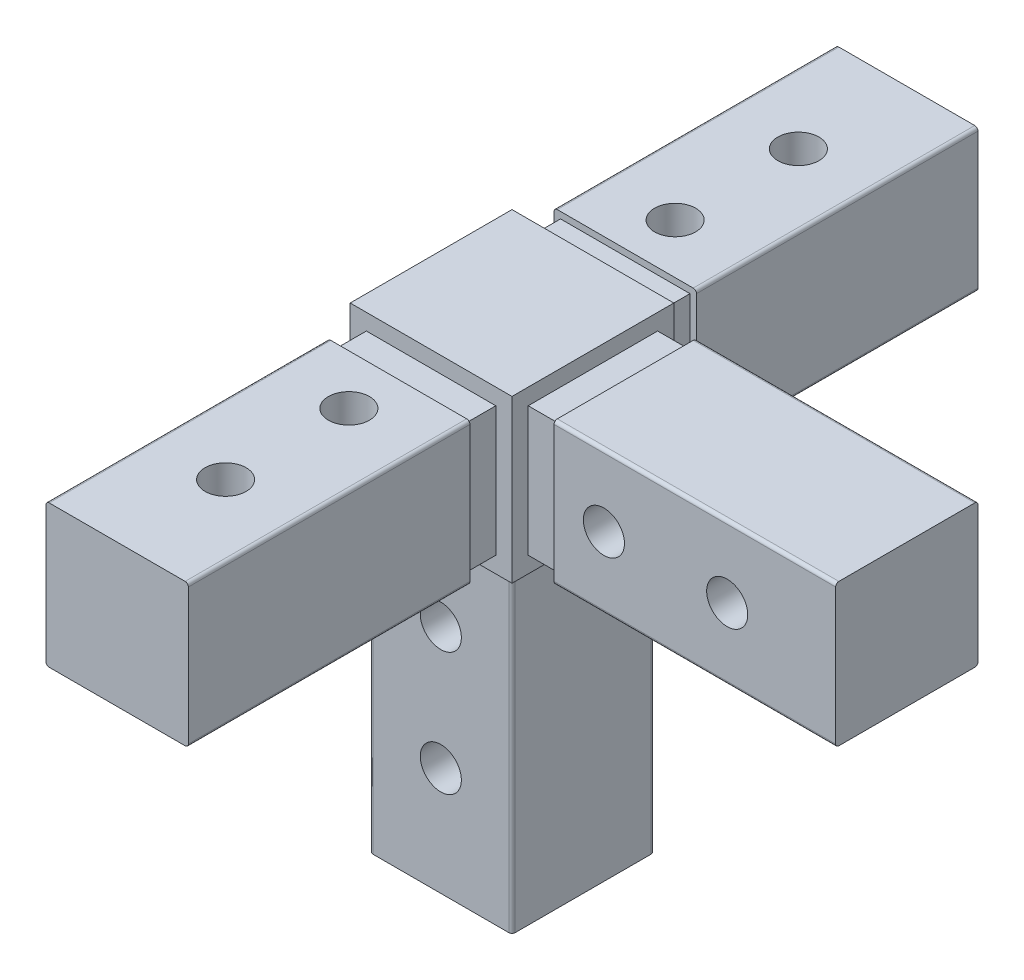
ISO-10303-21;
HEADER;
FILE_DESCRIPTION(('STEP AP214'),'2;1');
FILE_NAME('part.step','',(''),(''),'','','');
FILE_SCHEMA(('AUTOMOTIVE_DESIGN { 1 0 10303 214 1 1 1 1 }'));
ENDSEC;
DATA;
#1=APPLICATION_CONTEXT('core data for automotive mechanical design processes');
#2=APPLICATION_PROTOCOL_DEFINITION('international standard','automotive_design',2000,#1);
#3=PRODUCT_CONTEXT('',#1,'mechanical');
#4=PRODUCT('Part','Part','',(#3));
#5=PRODUCT_RELATED_PRODUCT_CATEGORY('part','',(#4));
#6=PRODUCT_DEFINITION_FORMATION('','',#4);
#7=PRODUCT_DEFINITION_CONTEXT('part definition',#1,'design');
#8=PRODUCT_DEFINITION('design','',#6,#7);
#9=PRODUCT_DEFINITION_SHAPE('','',#8);
#10=(LENGTH_UNIT() NAMED_UNIT(*) SI_UNIT(.MILLI.,.METRE.));
#11=(NAMED_UNIT(*) PLANE_ANGLE_UNIT() SI_UNIT($,.RADIAN.));
#12=(NAMED_UNIT(*) SI_UNIT($,.STERADIAN.) SOLID_ANGLE_UNIT());
#13=UNCERTAINTY_MEASURE_WITH_UNIT(LENGTH_MEASURE(1.E-05),#10,'distance_accuracy_value','');
#14=(GEOMETRIC_REPRESENTATION_CONTEXT(3) GLOBAL_UNCERTAINTY_ASSIGNED_CONTEXT((#13)) GLOBAL_UNIT_ASSIGNED_CONTEXT((#10,
#11,#12)) REPRESENTATION_CONTEXT('',''));
#15=CARTESIAN_POINT('',(0.,0.,0.));
#16=DIRECTION('',(0.,0.,1.));
#17=DIRECTION('',(1.,0.,0.));
#18=AXIS2_PLACEMENT_3D('',#15,#16,#17);
#19=CARTESIAN_POINT('',(0.,-12.5,0.));
#20=DIRECTION('',(0.,1.,0.));
#21=DIRECTION('',(0.,0.,1.));
#22=AXIS2_PLACEMENT_3D('',#19,#20,#21);
#23=PLANE('',#22);
#24=DIRECTION('',(-1.,0.,0.));
#25=VECTOR('',#24,1.);
#26=CARTESIAN_POINT('',(-10.,-12.5,12.5));
#27=LINE('',#26,#25);
#28=CARTESIAN_POINT('',(12.5,-12.5,12.5));
#29=VERTEX_POINT('',#28);
#30=CARTESIAN_POINT('',(-12.5,-12.5,12.5));
#31=VERTEX_POINT('',#30);
#32=EDGE_CURVE('E831',#29,#31,#27,.T.);
#33=ORIENTED_EDGE('',*,*,#32,.T.);
#34=DIRECTION('',(0.,0.,1.));
#35=VECTOR('',#34,1.);
#36=CARTESIAN_POINT('',(-12.5,-12.5,12.5));
#37=LINE('',#36,#35);
#38=CARTESIAN_POINT('',(-12.5,-12.5,-12.5));
#39=VERTEX_POINT('',#38);
#40=EDGE_CURVE('E812',#39,#31,#37,.T.);
#41=ORIENTED_EDGE('',*,*,#40,.F.);
#42=DIRECTION('',(1.,0.,0.));
#43=VECTOR('',#42,1.);
#44=CARTESIAN_POINT('',(12.5,-12.5,-12.5));
#45=LINE('',#44,#43);
#46=CARTESIAN_POINT('',(12.5,-12.5,-12.5));
#47=VERTEX_POINT('',#46);
#48=EDGE_CURVE('E822',#39,#47,#45,.T.);
#49=ORIENTED_EDGE('',*,*,#48,.T.);
#50=DIRECTION('',(0.,0.,1.));
#51=VECTOR('',#50,1.);
#52=CARTESIAN_POINT('',(12.5,-12.5,12.5));
#53=LINE('',#52,#51);
#54=EDGE_CURVE('E826',#47,#29,#53,.T.);
#55=ORIENTED_EDGE('',*,*,#54,.T.);
#56=EDGE_LOOP('',(#33,#41,#49,#55));
#57=FACE_BOUND('',#56,.T.);
#58=DIRECTION('',(0.,0.,-1.));
#59=VECTOR('',#58,1.);
#60=CARTESIAN_POINT('',(-11.,-12.5,-11.));
#61=LINE('',#60,#59);
#62=CARTESIAN_POINT('',(-11.,-12.5,10.4999999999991));
#63=VERTEX_POINT('',#62);
#64=CARTESIAN_POINT('',(-11.,-12.5,-10.4999999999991));
#65=VERTEX_POINT('',#64);
#66=EDGE_CURVE('E647',#63,#65,#61,.T.);
#67=ORIENTED_EDGE('',*,*,#66,.F.);
#68=CARTESIAN_POINT('',(-10.4999999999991,-12.5,10.4999999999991));
#69=DIRECTION('',(0.,1.,0.));
#70=DIRECTION('',(0.,0.,1.));
#71=AXIS2_PLACEMENT_3D('',#68,#69,#70);
#72=CIRCLE('',#71,0.500000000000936);
#73=CARTESIAN_POINT('',(-10.4999999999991,-12.5,11.));
#74=VERTEX_POINT('',#73);
#75=EDGE_CURVE('E54',#63,#74,#72,.T.);
#76=ORIENTED_EDGE('',*,*,#75,.T.);
#77=DIRECTION('',(-1.,0.,0.));
#78=VECTOR('',#77,1.);
#79=CARTESIAN_POINT('',(-11.,-12.5,11.));
#80=LINE('',#79,#78);
#81=CARTESIAN_POINT('',(10.4999999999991,-12.5,11.));
#82=VERTEX_POINT('',#81);
#83=EDGE_CURVE('E645',#82,#74,#80,.T.);
#84=ORIENTED_EDGE('',*,*,#83,.F.);
#85=CARTESIAN_POINT('',(10.4999999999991,-12.5,10.4999999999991));
#86=DIRECTION('',(0.,1.,0.));
#87=DIRECTION('',(0.,0.,1.));
#88=AXIS2_PLACEMENT_3D('',#85,#86,#87);
#89=CIRCLE('',#88,0.500000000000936);
#90=CARTESIAN_POINT('',(11.,-12.5,10.4999999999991));
#91=VERTEX_POINT('',#90);
#92=EDGE_CURVE('E638',#82,#91,#89,.T.);
#93=ORIENTED_EDGE('',*,*,#92,.T.);
#94=DIRECTION('',(0.,0.,1.));
#95=VECTOR('',#94,1.);
#96=CARTESIAN_POINT('',(11.,-12.5,11.));
#97=LINE('',#96,#95);
#98=CARTESIAN_POINT('',(11.,-12.5,-10.4999999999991));
#99=VERTEX_POINT('',#98);
#100=EDGE_CURVE('E658',#99,#91,#97,.T.);
#101=ORIENTED_EDGE('',*,*,#100,.F.);
#102=CARTESIAN_POINT('',(10.4999999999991,-12.5,-10.4999999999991));
#103=DIRECTION('',(0.,1.,0.));
#104=DIRECTION('',(0.,0.,1.));
#105=AXIS2_PLACEMENT_3D('',#102,#103,#104);
#106=CIRCLE('',#105,0.500000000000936);
#107=CARTESIAN_POINT('',(10.4999999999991,-12.5,-11.));
#108=VERTEX_POINT('',#107);
#109=EDGE_CURVE('E11',#99,#108,#106,.T.);
#110=ORIENTED_EDGE('',*,*,#109,.T.);
#111=DIRECTION('',(1.,0.,0.));
#112=VECTOR('',#111,1.);
#113=CARTESIAN_POINT('',(11.,-12.5,-11.));
#114=LINE('',#113,#112);
#115=CARTESIAN_POINT('',(-10.4999999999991,-12.5,-11.));
#116=VERTEX_POINT('',#115);
#117=EDGE_CURVE('E688',#116,#108,#114,.T.);
#118=ORIENTED_EDGE('',*,*,#117,.F.);
#119=CARTESIAN_POINT('',(-10.4999999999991,-12.5,-10.4999999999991));
#120=DIRECTION('',(0.,1.,0.));
#121=DIRECTION('',(0.,0.,1.));
#122=AXIS2_PLACEMENT_3D('',#119,#120,#121);
#123=CIRCLE('',#122,0.500000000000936);
#124=EDGE_CURVE('E635',#116,#65,#123,.T.);
#125=ORIENTED_EDGE('',*,*,#124,.T.);
#126=EDGE_LOOP('',(#67,#76,#84,#93,#101,#110,#118,#125));
#127=FACE_BOUND('',#126,.T.);
#128=ADVANCED_FACE('F45',(#57,#127),#23,.F.);
#129=CARTESIAN_POINT('',(17.5,-10.,10.));
#130=DIRECTION('',(0.,0.,-1.));
#131=DIRECTION('',(-1.,0.,0.));
#132=AXIS2_PLACEMENT_3D('',#129,#130,#131);
#133=PLANE('',#132);
#134=DIRECTION('',(0.,-1.,0.));
#135=VECTOR('',#134,1.);
#136=CARTESIAN_POINT('',(17.5,-11.,10.));
#137=LINE('',#136,#135);
#138=CARTESIAN_POINT('',(17.5,10.,10.));
#139=VERTEX_POINT('',#138);
#140=CARTESIAN_POINT('',(17.5,-10.,10.));
#141=VERTEX_POINT('',#140);
#142=EDGE_CURVE('E352',#139,#141,#137,.T.);
#143=ORIENTED_EDGE('',*,*,#142,.F.);
#144=DIRECTION('',(-1.,0.,0.));
#145=VECTOR('',#144,1.);
#146=CARTESIAN_POINT('',(17.5,10.,10.));
#147=LINE('',#146,#145);
#148=CARTESIAN_POINT('',(12.5,10.,10.));
#149=VERTEX_POINT('',#148);
#150=EDGE_CURVE('E356',#139,#149,#147,.T.);
#151=ORIENTED_EDGE('',*,*,#150,.T.);
#152=DIRECTION('',(0.,-1.,0.));
#153=VECTOR('',#152,1.);
#154=CARTESIAN_POINT('',(12.5,-10.,10.));
#155=LINE('',#154,#153);
#156=CARTESIAN_POINT('',(12.5,-10.,9.99999999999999));
#157=VERTEX_POINT('',#156);
#158=EDGE_CURVE('E388',#149,#157,#155,.T.);
#159=ORIENTED_EDGE('',*,*,#158,.T.);
#160=DIRECTION('',(-1.,0.,0.));
#161=VECTOR('',#160,1.);
#162=CARTESIAN_POINT('',(17.5,-10.,10.));
#163=LINE('',#162,#161);
#164=EDGE_CURVE('E357',#141,#157,#163,.T.);
#165=ORIENTED_EDGE('',*,*,#164,.F.);
#166=EDGE_LOOP('',(#143,#151,#159,#165));
#167=FACE_BOUND('',#166,.T.);
#168=ADVANCED_FACE('F354',(#167),#133,.F.);
#169=CARTESIAN_POINT('',(0.,-10.,0.));
#170=DIRECTION('',(0.,-1.,0.));
#171=DIRECTION('',(0.,0.,-1.));
#172=AXIS2_PLACEMENT_3D('',#169,#170,#171);
#173=PLANE('',#172);
#174=DIRECTION('',(-1.,0.,0.));
#175=VECTOR('',#174,1.);
#176=CARTESIAN_POINT('',(17.5,-10.,-10.));
#177=LINE('',#176,#175);
#178=CARTESIAN_POINT('',(17.5,-10.,-10.));
#179=VERTEX_POINT('',#178);
#180=CARTESIAN_POINT('',(12.5,-10.,-10.));
#181=VERTEX_POINT('',#180);
#182=EDGE_CURVE('E397',#179,#181,#177,.T.);
#183=ORIENTED_EDGE('',*,*,#182,.F.);
#184=DIRECTION('',(0.,0.,-1.));
#185=VECTOR('',#184,1.);
#186=CARTESIAN_POINT('',(17.5,-10.,-11.));
#187=LINE('',#186,#185);
#188=EDGE_CURVE('E701',#141,#179,#187,.T.);
#189=ORIENTED_EDGE('',*,*,#188,.F.);
#190=ORIENTED_EDGE('',*,*,#164,.T.);
#191=DIRECTION('',(0.,0.,1.));
#192=VECTOR('',#191,1.);
#193=CARTESIAN_POINT('',(12.5,-10.,12.5));
#194=LINE('',#193,#192);
#195=EDGE_CURVE('E827',#181,#157,#194,.T.);
#196=ORIENTED_EDGE('',*,*,#195,.F.);
#197=EDGE_LOOP('',(#183,#189,#190,#196));
#198=FACE_BOUND('',#197,.T.);
#199=ADVANCED_FACE('F940',(#198),#173,.T.);
#200=CARTESIAN_POINT('',(-10.,-10.,61.));
#201=DIRECTION('',(1.,0.,0.));
#202=DIRECTION('',(0.,0.,-1.));
#203=AXIS2_PLACEMENT_3D('',#200,#201,#202);
#204=PLANE('',#203);
#205=DIRECTION('',(0.,-1.,0.));
#206=VECTOR('',#205,1.);
#207=CARTESIAN_POINT('',(-10.,-11.,17.5));
#208=LINE('',#207,#206);
#209=CARTESIAN_POINT('',(-10.,10.,17.5));
#210=VERTEX_POINT('',#209);
#211=CARTESIAN_POINT('',(-10.,-10.,17.5));
#212=VERTEX_POINT('',#211);
#213=EDGE_CURVE('E711',#210,#212,#208,.T.);
#214=ORIENTED_EDGE('',*,*,#213,.F.);
#215=DIRECTION('',(0.,0.,-1.));
#216=VECTOR('',#215,1.);
#217=CARTESIAN_POINT('',(-10.,10.,61.));
#218=LINE('',#217,#216);
#219=CARTESIAN_POINT('',(-10.,10.,12.5));
#220=VERTEX_POINT('',#219);
#221=EDGE_CURVE('E774',#210,#220,#218,.T.);
#222=ORIENTED_EDGE('',*,*,#221,.T.);
#223=DIRECTION('',(0.,-1.,0.));
#224=VECTOR('',#223,1.);
#225=CARTESIAN_POINT('',(-10.,-10.,12.5));
#226=LINE('',#225,#224);
#227=CARTESIAN_POINT('',(-10.,-10.,12.5));
#228=VERTEX_POINT('',#227);
#229=EDGE_CURVE('E755',#220,#228,#226,.T.);
#230=ORIENTED_EDGE('',*,*,#229,.T.);
#231=DIRECTION('',(0.,0.,-1.));
#232=VECTOR('',#231,1.);
#233=CARTESIAN_POINT('',(-10.,-10.,61.));
#234=LINE('',#233,#232);
#235=EDGE_CURVE('E783',#212,#228,#234,.T.);
#236=ORIENTED_EDGE('',*,*,#235,.F.);
#237=EDGE_LOOP('',(#214,#222,#230,#236));
#238=FACE_BOUND('',#237,.T.);
#239=ADVANCED_FACE('F1593',(#238),#204,.F.);
#240=CARTESIAN_POINT('',(10.,-10.,61.));
#241=DIRECTION('',(0.,1.,0.));
#242=DIRECTION('',(0.,0.,1.));
#243=AXIS2_PLACEMENT_3D('',#240,#241,#242);
#244=PLANE('',#243);
#245=DIRECTION('',(1.,0.,0.));
#246=VECTOR('',#245,1.);
#247=CARTESIAN_POINT('',(11.,-10.,17.5));
#248=LINE('',#247,#246);
#249=CARTESIAN_POINT('',(10.,-10.,17.5));
#250=VERTEX_POINT('',#249);
#251=EDGE_CURVE('E722',#212,#250,#248,.T.);
#252=ORIENTED_EDGE('',*,*,#251,.F.);
#253=ORIENTED_EDGE('',*,*,#235,.T.);
#254=DIRECTION('',(1.,0.,0.));
#255=VECTOR('',#254,1.);
#256=CARTESIAN_POINT('',(10.,-10.,12.5));
#257=LINE('',#256,#255);
#258=CARTESIAN_POINT('',(10.,-10.,12.5));
#259=VERTEX_POINT('',#258);
#260=EDGE_CURVE('E762',#228,#259,#257,.T.);
#261=ORIENTED_EDGE('',*,*,#260,.T.);
#262=DIRECTION('',(0.,0.,-1.));
#263=VECTOR('',#262,1.);
#264=CARTESIAN_POINT('',(10.,-10.,61.));
#265=LINE('',#264,#263);
#266=EDGE_CURVE('E780',#250,#259,#265,.T.);
#267=ORIENTED_EDGE('',*,*,#266,.F.);
#268=EDGE_LOOP('',(#252,#253,#261,#267));
#269=FACE_BOUND('',#268,.T.);
#270=ADVANCED_FACE('F1607',(#269),#244,.F.);
#271=CARTESIAN_POINT('',(10.,10.,61.));
#272=DIRECTION('',(-1.,0.,0.));
#273=DIRECTION('',(0.,0.,1.));
#274=AXIS2_PLACEMENT_3D('',#271,#272,#273);
#275=PLANE('',#274);
#276=DIRECTION('',(0.,1.,0.));
#277=VECTOR('',#276,1.);
#278=CARTESIAN_POINT('',(10.,11.,17.5));
#279=LINE('',#278,#277);
#280=CARTESIAN_POINT('',(10.,10.,17.5));
#281=VERTEX_POINT('',#280);
#282=EDGE_CURVE('E733',#250,#281,#279,.T.);
#283=ORIENTED_EDGE('',*,*,#282,.F.);
#284=ORIENTED_EDGE('',*,*,#266,.T.);
#285=DIRECTION('',(0.,1.,0.));
#286=VECTOR('',#285,1.);
#287=CARTESIAN_POINT('',(10.,10.,12.5));
#288=LINE('',#287,#286);
#289=CARTESIAN_POINT('',(10.,10.,12.5));
#290=VERTEX_POINT('',#289);
#291=EDGE_CURVE('E766',#259,#290,#288,.T.);
#292=ORIENTED_EDGE('',*,*,#291,.T.);
#293=DIRECTION('',(0.,0.,-1.));
#294=VECTOR('',#293,1.);
#295=CARTESIAN_POINT('',(10.,10.,61.));
#296=LINE('',#295,#294);
#297=EDGE_CURVE('E777',#281,#290,#296,.T.);
#298=ORIENTED_EDGE('',*,*,#297,.F.);
#299=EDGE_LOOP('',(#283,#284,#292,#298));
#300=FACE_BOUND('',#299,.T.);
#301=ADVANCED_FACE('F1627',(#300),#275,.F.);
#302=CARTESIAN_POINT('',(-10.,10.,61.));
#303=DIRECTION('',(0.,-1.,0.));
#304=DIRECTION('',(0.,0.,-1.));
#305=AXIS2_PLACEMENT_3D('',#302,#303,#304);
#306=PLANE('',#305);
#307=DIRECTION('',(-1.,0.,0.));
#308=VECTOR('',#307,1.);
#309=CARTESIAN_POINT('',(-10.,10.,17.5));
#310=LINE('',#309,#308);
#311=EDGE_CURVE('E744',#281,#210,#310,.T.);
#312=ORIENTED_EDGE('',*,*,#311,.F.);
#313=ORIENTED_EDGE('',*,*,#297,.T.);
#314=DIRECTION('',(-1.,0.,0.));
#315=VECTOR('',#314,1.);
#316=CARTESIAN_POINT('',(-10.,10.,12.5));
#317=LINE('',#316,#315);
#318=EDGE_CURVE('E770',#290,#220,#317,.T.);
#319=ORIENTED_EDGE('',*,*,#318,.T.);
#320=ORIENTED_EDGE('',*,*,#221,.F.);
#321=EDGE_LOOP('',(#312,#313,#319,#320));
#322=FACE_BOUND('',#321,.T.);
#323=ADVANCED_FACE('F1064',(#322),#306,.F.);
#324=CARTESIAN_POINT('',(0.,10.,0.));
#325=DIRECTION('',(0.,-1.,0.));
#326=DIRECTION('',(0.,0.,-1.));
#327=AXIS2_PLACEMENT_3D('',#324,#325,#326);
#328=PLANE('',#327);
#329=DIRECTION('',(0.,0.,-1.));
#330=VECTOR('',#329,1.);
#331=CARTESIAN_POINT('',(12.5,10.,-12.5));
#332=LINE('',#331,#330);
#333=CARTESIAN_POINT('',(12.5,10.,-10.));
#334=VERTEX_POINT('',#333);
#335=EDGE_CURVE('E372',#149,#334,#332,.T.);
#336=ORIENTED_EDGE('',*,*,#335,.F.);
#337=ORIENTED_EDGE('',*,*,#150,.F.);
#338=DIRECTION('',(0.,0.,1.));
#339=VECTOR('',#338,1.);
#340=CARTESIAN_POINT('',(17.5,10.,10.));
#341=LINE('',#340,#339);
#342=CARTESIAN_POINT('',(17.5,10.,-10.));
#343=VERTEX_POINT('',#342);
#344=EDGE_CURVE('E370',#343,#139,#341,.T.);
#345=ORIENTED_EDGE('',*,*,#344,.F.);
#346=DIRECTION('',(-1.,0.,0.));
#347=VECTOR('',#346,1.);
#348=CARTESIAN_POINT('',(17.5,10.,-10.));
#349=LINE('',#348,#347);
#350=EDGE_CURVE('E375',#343,#334,#349,.T.);
#351=ORIENTED_EDGE('',*,*,#350,.T.);
#352=EDGE_LOOP('',(#336,#337,#345,#351));
#353=FACE_BOUND('',#352,.T.);
#354=ADVANCED_FACE('F368',(#353),#328,.F.);
#355=DIRECTION('',(-1.,0.,0.));
#356=VECTOR('',#355,1.);
#357=CARTESIAN_POINT('',(-12.5,10.,-12.5));
#358=LINE('',#357,#356);
#359=CARTESIAN_POINT('',(10.,10.,-12.5));
#360=VERTEX_POINT('',#359);
#361=CARTESIAN_POINT('',(-10.,10.,-12.5));
#362=VERTEX_POINT('',#361);
#363=EDGE_CURVE('E791',#360,#362,#358,.T.);
#364=ORIENTED_EDGE('',*,*,#363,.F.);
#365=DIRECTION('',(0.,0.,1.));
#366=VECTOR('',#365,1.);
#367=CARTESIAN_POINT('',(10.,10.,-17.5));
#368=LINE('',#367,#366);
#369=CARTESIAN_POINT('',(10.,10.,-17.5));
#370=VERTEX_POINT('',#369);
#371=EDGE_CURVE('E404',#370,#360,#368,.T.);
#372=ORIENTED_EDGE('',*,*,#371,.F.);
#373=DIRECTION('',(1.,0.,0.));
#374=VECTOR('',#373,1.);
#375=CARTESIAN_POINT('',(-10.,10.,-17.5));
#376=LINE('',#375,#374);
#377=CARTESIAN_POINT('',(-10.,10.,-17.5));
#378=VERTEX_POINT('',#377);
#379=EDGE_CURVE('E425',#378,#370,#376,.T.);
#380=ORIENTED_EDGE('',*,*,#379,.F.);
#381=DIRECTION('',(0.,0.,-1.));
#382=VECTOR('',#381,1.);
#383=CARTESIAN_POINT('',(-10.,10.,12.5));
#384=LINE('',#383,#382);
#385=EDGE_CURVE('E422',#362,#378,#384,.T.);
#386=ORIENTED_EDGE('',*,*,#385,.F.);
#387=EDGE_LOOP('',(#364,#372,#380,#386));
#388=FACE_BOUND('',#387,.T.);
#389=ADVANCED_FACE('F1048',(#388),#328,.F.);
#390=CARTESIAN_POINT('',(-10.,10.,12.5));
#391=DIRECTION('',(-1.,0.,0.));
#392=DIRECTION('',(0.,0.,1.));
#393=AXIS2_PLACEMENT_3D('',#390,#391,#392);
#394=PLANE('',#393);
#395=DIRECTION('',(0.,0.,-1.));
#396=VECTOR('',#395,1.);
#397=CARTESIAN_POINT('',(-10.,-10.,12.5));
#398=LINE('',#397,#396);
#399=CARTESIAN_POINT('',(-10.,-10.,-12.5));
#400=VERTEX_POINT('',#399);
#401=CARTESIAN_POINT('',(-10.,-10.,-17.5));
#402=VERTEX_POINT('',#401);
#403=EDGE_CURVE('E419',#400,#402,#398,.T.);
#404=ORIENTED_EDGE('',*,*,#403,.F.);
#405=DIRECTION('',(0.,-1.,0.));
#406=VECTOR('',#405,1.);
#407=CARTESIAN_POINT('',(-10.,-12.5,-12.5));
#408=LINE('',#407,#406);
#409=EDGE_CURVE('E803',#362,#400,#408,.T.);
#410=ORIENTED_EDGE('',*,*,#409,.F.);
#411=ORIENTED_EDGE('',*,*,#385,.T.);
#412=DIRECTION('',(0.,-1.,0.));
#413=VECTOR('',#412,1.);
#414=CARTESIAN_POINT('',(-10.,10.,-17.5));
#415=LINE('',#414,#413);
#416=EDGE_CURVE('E429',#378,#402,#415,.T.);
#417=ORIENTED_EDGE('',*,*,#416,.T.);
#418=EDGE_LOOP('',(#404,#410,#411,#417));
#419=FACE_BOUND('',#418,.T.);
#420=ADVANCED_FACE('F1044',(#419),#394,.T.);
#421=DIRECTION('',(0.,0.,-1.));
#422=VECTOR('',#421,1.);
#423=CARTESIAN_POINT('',(10.,-10.,-12.5));
#424=LINE('',#423,#422);
#425=CARTESIAN_POINT('',(10.,-10.,-12.5));
#426=VERTEX_POINT('',#425);
#427=CARTESIAN_POINT('',(10.,-10.,-17.5));
#428=VERTEX_POINT('',#427);
#429=EDGE_CURVE('E411',#426,#428,#424,.T.);
#430=ORIENTED_EDGE('',*,*,#429,.F.);
#431=DIRECTION('',(1.,0.,0.));
#432=VECTOR('',#431,1.);
#433=CARTESIAN_POINT('',(12.5,-10.,-12.5));
#434=LINE('',#433,#432);
#435=EDGE_CURVE('E819',#400,#426,#434,.T.);
#436=ORIENTED_EDGE('',*,*,#435,.F.);
#437=ORIENTED_EDGE('',*,*,#403,.T.);
#438=DIRECTION('',(1.,0.,0.));
#439=VECTOR('',#438,1.);
#440=CARTESIAN_POINT('',(-10.,-10.,-17.5));
#441=LINE('',#440,#439);
#442=EDGE_CURVE('E426',#402,#428,#441,.T.);
#443=ORIENTED_EDGE('',*,*,#442,.T.);
#444=EDGE_LOOP('',(#430,#436,#437,#443));
#445=FACE_BOUND('',#444,.T.);
#446=ADVANCED_FACE('F1047',(#445),#173,.T.);
#447=CARTESIAN_POINT('',(12.5,10.,12.5));
#448=DIRECTION('',(0.,0.,1.));
#449=DIRECTION('',(1.,0.,0.));
#450=AXIS2_PLACEMENT_3D('',#447,#448,#449);
#451=PLANE('',#450);
#452=ORIENTED_EDGE('',*,*,#229,.F.);
#453=ORIENTED_EDGE('',*,*,#318,.F.);
#454=ORIENTED_EDGE('',*,*,#291,.F.);
#455=ORIENTED_EDGE('',*,*,#260,.F.);
#456=EDGE_LOOP('',(#452,#453,#454,#455));
#457=FACE_BOUND('',#456,.T.);
#458=DIRECTION('',(0.,-1.,0.));
#459=VECTOR('',#458,1.);
#460=CARTESIAN_POINT('',(12.5,10.,12.5));
#461=LINE('',#460,#459);
#462=CARTESIAN_POINT('',(12.5,12.5,12.5));
#463=VERTEX_POINT('',#462);
#464=EDGE_CURVE('E435',#463,#29,#461,.T.);
#465=ORIENTED_EDGE('',*,*,#464,.F.);
#466=DIRECTION('',(1.,0.,0.));
#467=VECTOR('',#466,1.);
#468=CARTESIAN_POINT('',(12.5,12.5,12.5));
#469=LINE('',#468,#467);
#470=CARTESIAN_POINT('',(-12.5,12.5,12.5));
#471=VERTEX_POINT('',#470);
#472=EDGE_CURVE('E790',#471,#463,#469,.T.);
#473=ORIENTED_EDGE('',*,*,#472,.F.);
#474=DIRECTION('',(0.,1.,0.));
#475=VECTOR('',#474,1.);
#476=CARTESIAN_POINT('',(-12.5,10.,12.5));
#477=LINE('',#476,#475);
#478=EDGE_CURVE('E816',#31,#471,#477,.T.);
#479=ORIENTED_EDGE('',*,*,#478,.F.);
#480=ORIENTED_EDGE('',*,*,#32,.F.);
#481=EDGE_LOOP('',(#465,#473,#479,#480));
#482=FACE_BOUND('',#481,.T.);
#483=ADVANCED_FACE('F1054',(#457,#482),#451,.T.);
#484=CARTESIAN_POINT('',(12.5,10.,-17.5));
#485=DIRECTION('',(1.,0.,0.));
#486=DIRECTION('',(0.,0.,-1.));
#487=AXIS2_PLACEMENT_3D('',#484,#485,#486);
#488=PLANE('',#487);
#489=DIRECTION('',(0.,0.,-1.));
#490=VECTOR('',#489,1.);
#491=CARTESIAN_POINT('',(12.5,12.5,-12.5));
#492=LINE('',#491,#490);
#493=CARTESIAN_POINT('',(12.5,12.5,-12.5));
#494=VERTEX_POINT('',#493);
#495=EDGE_CURVE('E795',#463,#494,#492,.T.);
#496=ORIENTED_EDGE('',*,*,#495,.F.);
#497=ORIENTED_EDGE('',*,*,#464,.T.);
#498=ORIENTED_EDGE('',*,*,#54,.F.);
#499=DIRECTION('',(0.,-1.,0.));
#500=VECTOR('',#499,1.);
#501=CARTESIAN_POINT('',(12.5,10.,-12.5));
#502=LINE('',#501,#500);
#503=EDGE_CURVE('E403',#494,#47,#502,.T.);
#504=ORIENTED_EDGE('',*,*,#503,.F.);
#505=EDGE_LOOP('',(#496,#497,#498,#504));
#506=FACE_BOUND('',#505,.T.);
#507=DIRECTION('',(0.,1.,0.));
#508=VECTOR('',#507,1.);
#509=CARTESIAN_POINT('',(12.5,10.,-10.));
#510=LINE('',#509,#508);
#511=EDGE_CURVE('E384',#181,#334,#510,.T.);
#512=ORIENTED_EDGE('',*,*,#511,.F.);
#513=ORIENTED_EDGE('',*,*,#195,.T.);
#514=ORIENTED_EDGE('',*,*,#158,.F.);
#515=ORIENTED_EDGE('',*,*,#335,.T.);
#516=EDGE_LOOP('',(#512,#513,#514,#515));
#517=FACE_BOUND('',#516,.T.);
#518=ADVANCED_FACE('F1050',(#506,#517),#488,.T.);
#519=CARTESIAN_POINT('',(10.,10.,-12.5));
#520=DIRECTION('',(0.,0.,1.));
#521=DIRECTION('',(1.,0.,0.));
#522=AXIS2_PLACEMENT_3D('',#519,#520,#521);
#523=PLANE('',#522);
#524=ORIENTED_EDGE('',*,*,#363,.T.);
#525=ORIENTED_EDGE('',*,*,#409,.T.);
#526=ORIENTED_EDGE('',*,*,#435,.T.);
#527=DIRECTION('',(0.,-1.,0.));
#528=VECTOR('',#527,1.);
#529=CARTESIAN_POINT('',(10.,10.,-12.5));
#530=LINE('',#529,#528);
#531=EDGE_CURVE('E408',#360,#426,#530,.T.);
#532=ORIENTED_EDGE('',*,*,#531,.F.);
#533=EDGE_LOOP('',(#524,#525,#526,#532));
#534=FACE_BOUND('',#533,.T.);
#535=ORIENTED_EDGE('',*,*,#503,.T.);
#536=ORIENTED_EDGE('',*,*,#48,.F.);
#537=DIRECTION('',(0.,-1.,0.));
#538=VECTOR('',#537,1.);
#539=CARTESIAN_POINT('',(-12.5,-12.5,-12.5));
#540=LINE('',#539,#538);
#541=CARTESIAN_POINT('',(-12.5,12.5,-12.5));
#542=VERTEX_POINT('',#541);
#543=EDGE_CURVE('E808',#542,#39,#540,.T.);
#544=ORIENTED_EDGE('',*,*,#543,.F.);
#545=DIRECTION('',(-1.,0.,0.));
#546=VECTOR('',#545,1.);
#547=CARTESIAN_POINT('',(-12.5,12.5,-12.5));
#548=LINE('',#547,#546);
#549=EDGE_CURVE('E799',#494,#542,#548,.T.);
#550=ORIENTED_EDGE('',*,*,#549,.F.);
#551=EDGE_LOOP('',(#535,#536,#544,#550));
#552=FACE_BOUND('',#551,.T.);
#553=ADVANCED_FACE('F1053',(#534,#552),#523,.F.);
#554=CARTESIAN_POINT('',(10.,0.,0.));
#555=DIRECTION('',(1.,0.,0.));
#556=DIRECTION('',(0.,0.,-1.));
#557=AXIS2_PLACEMENT_3D('',#554,#555,#556);
#558=PLANE('',#557);
#559=ORIENTED_EDGE('',*,*,#371,.T.);
#560=ORIENTED_EDGE('',*,*,#531,.T.);
#561=ORIENTED_EDGE('',*,*,#429,.T.);
#562=DIRECTION('',(0.,1.,0.));
#563=VECTOR('',#562,1.);
#564=CARTESIAN_POINT('',(10.,-10.,-17.5));
#565=LINE('',#564,#563);
#566=EDGE_CURVE('E415',#428,#370,#565,.T.);
#567=ORIENTED_EDGE('',*,*,#566,.T.);
#568=EDGE_LOOP('',(#559,#560,#561,#567));
#569=FACE_BOUND('',#568,.T.);
#570=ADVANCED_FACE('F1067',(#569),#558,.T.);
#571=CARTESIAN_POINT('',(17.5,10.,-10.));
#572=DIRECTION('',(0.,0.,1.));
#573=DIRECTION('',(1.,0.,0.));
#574=AXIS2_PLACEMENT_3D('',#571,#572,#573);
#575=PLANE('',#574);
#576=ORIENTED_EDGE('',*,*,#511,.T.);
#577=ORIENTED_EDGE('',*,*,#350,.F.);
#578=DIRECTION('',(0.,1.,0.));
#579=VECTOR('',#578,1.);
#580=CARTESIAN_POINT('',(17.5,10.,-10.));
#581=LINE('',#580,#579);
#582=EDGE_CURVE('E380',#179,#343,#581,.T.);
#583=ORIENTED_EDGE('',*,*,#582,.F.);
#584=ORIENTED_EDGE('',*,*,#182,.T.);
#585=EDGE_LOOP('',(#576,#577,#583,#584));
#586=FACE_BOUND('',#585,.T.);
#587=ADVANCED_FACE('F1070',(#586),#575,.F.);
#588=CARTESIAN_POINT('',(61.,11.,-11.));
#589=DIRECTION('',(0.,0.,1.));
#590=DIRECTION('',(0.,-1.,0.));
#591=AXIS2_PLACEMENT_3D('',#588,#589,#590);
#592=PLANE('',#591);
#593=CARTESIAN_POINT('',(44.25,0.,-11.));
#594=DIRECTION('',(0.,0.,1.));
#595=DIRECTION('',(1.,0.,0.));
#596=AXIS2_PLACEMENT_3D('',#593,#594,#595);
#597=CIRCLE('',#596,3.175);
#598=CARTESIAN_POINT('',(47.425,0.,-11.));
#599=VERTEX_POINT('',#598);
#600=EDGE_CURVE('E2001',#599,#599,#597,.F.);
#601=ORIENTED_EDGE('',*,*,#600,.F.);
#602=EDGE_LOOP('',(#601));
#603=FACE_BOUND('',#602,.T.);
#604=CARTESIAN_POINT('',(25.2,0.,-11.));
#605=DIRECTION('',(0.,0.,1.));
#606=DIRECTION('',(1.,0.,0.));
#607=AXIS2_PLACEMENT_3D('',#604,#605,#606);
#608=CIRCLE('',#607,3.175);
#609=CARTESIAN_POINT('',(28.375,0.,-11.));
#610=VERTEX_POINT('',#609);
#611=EDGE_CURVE('E2006',#610,#610,#608,.F.);
#612=ORIENTED_EDGE('',*,*,#611,.F.);
#613=EDGE_LOOP('',(#612));
#614=FACE_BOUND('',#613,.T.);
#615=DIRECTION('',(0.,1.,0.));
#616=VECTOR('',#615,1.);
#617=CARTESIAN_POINT('',(17.5,11.,-11.));
#618=LINE('',#617,#616);
#619=CARTESIAN_POINT('',(17.5,-10.4999999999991,-11.));
#620=VERTEX_POINT('',#619);
#621=CARTESIAN_POINT('',(17.5,10.4999999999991,-11.));
#622=VERTEX_POINT('',#621);
#623=EDGE_CURVE('E857',#620,#622,#618,.T.);
#624=ORIENTED_EDGE('',*,*,#623,.T.);
#625=DIRECTION('',(-1.,0.,0.));
#626=VECTOR('',#625,1.);
#627=CARTESIAN_POINT('',(61.,10.4999999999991,-11.));
#628=LINE('',#627,#626);
#629=CARTESIAN_POINT('',(61.,10.4999999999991,-11.));
#630=VERTEX_POINT('',#629);
#631=EDGE_CURVE('E568',#622,#630,#628,.F.);
#632=ORIENTED_EDGE('',*,*,#631,.T.);
#633=DIRECTION('',(0.,1.,0.));
#634=VECTOR('',#633,1.);
#635=CARTESIAN_POINT('',(61.,11.,-11.));
#636=LINE('',#635,#634);
#637=CARTESIAN_POINT('',(61.,-10.4999999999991,-11.));
#638=VERTEX_POINT('',#637);
#639=EDGE_CURVE('E872',#638,#630,#636,.T.);
#640=ORIENTED_EDGE('',*,*,#639,.F.);
#641=DIRECTION('',(1.,0.,0.));
#642=VECTOR('',#641,1.);
#643=CARTESIAN_POINT('',(61.,-10.4999999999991,-11.));
#644=LINE('',#643,#642);
#645=EDGE_CURVE('E565',#638,#620,#644,.F.);
#646=ORIENTED_EDGE('',*,*,#645,.T.);
#647=EDGE_LOOP('',(#624,#632,#640,#646));
#648=FACE_BOUND('',#647,.T.);
#649=ADVANCED_FACE('F917',(#603,#614,#648),#592,.F.);
#650=CARTESIAN_POINT('',(61.,11.,10.));
#651=DIRECTION('',(0.,-1.,0.));
#652=DIRECTION('',(0.,0.,-1.));
#653=AXIS2_PLACEMENT_3D('',#650,#651,#652);
#654=PLANE('',#653);
#655=DIRECTION('',(0.,0.,1.));
#656=VECTOR('',#655,1.);
#657=CARTESIAN_POINT('',(61.,11.,10.));
#658=LINE('',#657,#656);
#659=CARTESIAN_POINT('',(61.,11.,-10.4999999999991));
#660=VERTEX_POINT('',#659);
#661=CARTESIAN_POINT('',(61.,11.,10.4999999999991));
#662=VERTEX_POINT('',#661);
#663=EDGE_CURVE('E391',#660,#662,#658,.T.);
#664=ORIENTED_EDGE('',*,*,#663,.F.);
#665=DIRECTION('',(-1.,0.,0.));
#666=VECTOR('',#665,1.);
#667=CARTESIAN_POINT('',(61.,11.,-10.4999999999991));
#668=LINE('',#667,#666);
#669=CARTESIAN_POINT('',(17.5,11.,-10.4999999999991));
#670=VERTEX_POINT('',#669);
#671=EDGE_CURVE('E561',#660,#670,#668,.T.);
#672=ORIENTED_EDGE('',*,*,#671,.T.);
#673=DIRECTION('',(0.,0.,1.));
#674=VECTOR('',#673,1.);
#675=CARTESIAN_POINT('',(17.5,11.,10.));
#676=LINE('',#675,#674);
#677=CARTESIAN_POINT('',(17.5,11.,10.4999999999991));
#678=VERTEX_POINT('',#677);
#679=EDGE_CURVE('E876',#670,#678,#676,.T.);
#680=ORIENTED_EDGE('',*,*,#679,.T.);
#681=DIRECTION('',(-1.,0.,0.));
#682=VECTOR('',#681,1.);
#683=CARTESIAN_POINT('',(61.,11.,10.4999999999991));
#684=LINE('',#683,#682);
#685=EDGE_CURVE('E558',#678,#662,#684,.F.);
#686=ORIENTED_EDGE('',*,*,#685,.T.);
#687=EDGE_LOOP('',(#664,#672,#680,#686));
#688=FACE_BOUND('',#687,.T.);
#689=ADVANCED_FACE('F888',(#688),#654,.F.);
#690=CARTESIAN_POINT('',(61.,0.,0.));
#691=DIRECTION('',(-1.,0.,0.));
#692=DIRECTION('',(0.,0.,1.));
#693=AXIS2_PLACEMENT_3D('',#690,#691,#692);
#694=PLANE('',#693);
#695=DIRECTION('',(0.,1.,0.));
#696=VECTOR('',#695,1.);
#697=CARTESIAN_POINT('',(61.,11.,11.));
#698=LINE('',#697,#696);
#699=CARTESIAN_POINT('',(61.,-10.4999999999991,11.));
#700=VERTEX_POINT('',#699);
#701=CARTESIAN_POINT('',(61.,10.4999999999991,11.));
#702=VERTEX_POINT('',#701);
#703=EDGE_CURVE('E698',#700,#702,#698,.T.);
#704=ORIENTED_EDGE('',*,*,#703,.F.);
#705=CARTESIAN_POINT('',(61.,-10.4999999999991,10.4999999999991));
#706=DIRECTION('',(-1.,0.,0.));
#707=DIRECTION('',(0.,0.,1.));
#708=AXIS2_PLACEMENT_3D('',#705,#706,#707);
#709=CIRCLE('',#708,0.500000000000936);
#710=CARTESIAN_POINT('',(61.,-11.,10.4999999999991));
#711=VERTEX_POINT('',#710);
#712=EDGE_CURVE('E458',#700,#711,#709,.F.);
#713=ORIENTED_EDGE('',*,*,#712,.T.);
#714=DIRECTION('',(0.,0.,1.));
#715=VECTOR('',#714,1.);
#716=CARTESIAN_POINT('',(61.,-11.,10.));
#717=LINE('',#716,#715);
#718=CARTESIAN_POINT('',(61.,-11.,-10.4999999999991));
#719=VERTEX_POINT('',#718);
#720=EDGE_CURVE('E707',#719,#711,#717,.T.);
#721=ORIENTED_EDGE('',*,*,#720,.F.);
#722=CARTESIAN_POINT('',(61.,-10.4999999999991,-10.4999999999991));
#723=DIRECTION('',(-1.,0.,0.));
#724=DIRECTION('',(0.,0.,1.));
#725=AXIS2_PLACEMENT_3D('',#722,#723,#724);
#726=CIRCLE('',#725,0.500000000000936);
#727=EDGE_CURVE('E449',#719,#638,#726,.F.);
#728=ORIENTED_EDGE('',*,*,#727,.T.);
#729=ORIENTED_EDGE('',*,*,#639,.T.);
#730=CARTESIAN_POINT('',(61.,10.4999999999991,-10.4999999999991));
#731=DIRECTION('',(-1.,0.,0.));
#732=DIRECTION('',(0.,0.,1.));
#733=AXIS2_PLACEMENT_3D('',#730,#731,#732);
#734=CIRCLE('',#733,0.500000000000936);
#735=EDGE_CURVE('E455',#630,#660,#734,.F.);
#736=ORIENTED_EDGE('',*,*,#735,.T.);
#737=ORIENTED_EDGE('',*,*,#663,.T.);
#738=CARTESIAN_POINT('',(61.,10.4999999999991,10.4999999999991));
#739=DIRECTION('',(-1.,0.,0.));
#740=DIRECTION('',(0.,0.,1.));
#741=AXIS2_PLACEMENT_3D('',#738,#739,#740);
#742=CIRCLE('',#741,0.500000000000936);
#743=EDGE_CURVE('E452',#662,#702,#742,.F.);
#744=ORIENTED_EDGE('',*,*,#743,.T.);
#745=EDGE_LOOP('',(#704,#713,#721,#728,#729,#736,#737,#744));
#746=FACE_BOUND('',#745,.T.);
#747=ADVANCED_FACE('F896',(#746),#694,.F.);
#748=CARTESIAN_POINT('',(17.5,0.,0.));
#749=DIRECTION('',(-1.,0.,0.));
#750=DIRECTION('',(0.,0.,1.));
#751=AXIS2_PLACEMENT_3D('',#748,#749,#750);
#752=PLANE('',#751);
#753=ORIENTED_EDGE('',*,*,#344,.T.);
#754=ORIENTED_EDGE('',*,*,#142,.T.);
#755=ORIENTED_EDGE('',*,*,#188,.T.);
#756=ORIENTED_EDGE('',*,*,#582,.T.);
#757=EDGE_LOOP('',(#753,#754,#755,#756));
#758=FACE_BOUND('',#757,.T.);
#759=DIRECTION('',(0.,0.,-1.));
#760=VECTOR('',#759,1.);
#761=CARTESIAN_POINT('',(17.5,-11.,-11.));
#762=LINE('',#761,#760);
#763=CARTESIAN_POINT('',(17.5,-11.,10.4999999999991));
#764=VERTEX_POINT('',#763);
#765=CARTESIAN_POINT('',(17.5,-11.,-10.4999999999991));
#766=VERTEX_POINT('',#765);
#767=EDGE_CURVE('E703',#764,#766,#762,.T.);
#768=ORIENTED_EDGE('',*,*,#767,.F.);
#769=CARTESIAN_POINT('',(17.5,-10.4999999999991,10.4999999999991));
#770=DIRECTION('',(-1.,0.,0.));
#771=DIRECTION('',(0.,0.,1.));
#772=AXIS2_PLACEMENT_3D('',#769,#770,#771);
#773=CIRCLE('',#772,0.500000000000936);
#774=CARTESIAN_POINT('',(17.5,-10.4999999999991,11.));
#775=VERTEX_POINT('',#774);
#776=EDGE_CURVE('E477',#764,#775,#773,.T.);
#777=ORIENTED_EDGE('',*,*,#776,.T.);
#778=DIRECTION('',(0.,-1.,0.));
#779=VECTOR('',#778,1.);
#780=CARTESIAN_POINT('',(17.5,-11.,11.));
#781=LINE('',#780,#779);
#782=CARTESIAN_POINT('',(17.5,10.4999999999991,11.));
#783=VERTEX_POINT('',#782);
#784=EDGE_CURVE('E363',#783,#775,#781,.T.);
#785=ORIENTED_EDGE('',*,*,#784,.F.);
#786=CARTESIAN_POINT('',(17.5,10.4999999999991,10.4999999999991));
#787=DIRECTION('',(-1.,0.,0.));
#788=DIRECTION('',(0.,0.,1.));
#789=AXIS2_PLACEMENT_3D('',#786,#787,#788);
#790=CIRCLE('',#789,0.500000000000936);
#791=EDGE_CURVE('E471',#783,#678,#790,.T.);
#792=ORIENTED_EDGE('',*,*,#791,.T.);
#793=ORIENTED_EDGE('',*,*,#679,.F.);
#794=CARTESIAN_POINT('',(17.5,10.4999999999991,-10.4999999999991));
#795=DIRECTION('',(-1.,0.,0.));
#796=DIRECTION('',(0.,0.,1.));
#797=AXIS2_PLACEMENT_3D('',#794,#795,#796);
#798=CIRCLE('',#797,0.500000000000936);
#799=EDGE_CURVE('E474',#670,#622,#798,.T.);
#800=ORIENTED_EDGE('',*,*,#799,.T.);
#801=ORIENTED_EDGE('',*,*,#623,.F.);
#802=CARTESIAN_POINT('',(17.5,-10.4999999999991,-10.4999999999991));
#803=DIRECTION('',(-1.,0.,0.));
#804=DIRECTION('',(0.,0.,1.));
#805=AXIS2_PLACEMENT_3D('',#802,#803,#804);
#806=CIRCLE('',#805,0.500000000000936);
#807=EDGE_CURVE('E468',#620,#766,#806,.T.);
#808=ORIENTED_EDGE('',*,*,#807,.T.);
#809=EDGE_LOOP('',(#768,#777,#785,#792,#793,#800,#801,#808));
#810=FACE_BOUND('',#809,.T.);
#811=ADVANCED_FACE('F377',(#758,#810),#752,.T.);
#812=CARTESIAN_POINT('',(11.,11.,-61.));
#813=DIRECTION('',(0.,1.,0.));
#814=DIRECTION('',(-1.,0.,0.));
#815=AXIS2_PLACEMENT_3D('',#812,#813,#814);
#816=PLANE('',#815);
#817=CARTESIAN_POINT('',(0.,11.,-44.25));
#818=DIRECTION('',(0.,1.,0.));
#819=DIRECTION('',(-1.,0.,0.));
#820=AXIS2_PLACEMENT_3D('',#817,#818,#819);
#821=CIRCLE('',#820,3.175);
#822=CARTESIAN_POINT('',(-3.175,11.,-44.25));
#823=VERTEX_POINT('',#822);
#824=EDGE_CURVE('E2026',#823,#823,#821,.F.);
#825=ORIENTED_EDGE('',*,*,#824,.T.);
#826=EDGE_LOOP('',(#825));
#827=FACE_BOUND('',#826,.T.);
#828=CARTESIAN_POINT('',(0.,11.,-25.2));
#829=DIRECTION('',(0.,1.,0.));
#830=DIRECTION('',(-1.,0.,0.));
#831=AXIS2_PLACEMENT_3D('',#828,#829,#830);
#832=CIRCLE('',#831,3.175);
#833=CARTESIAN_POINT('',(-3.175,11.,-25.2));
#834=VERTEX_POINT('',#833);
#835=EDGE_CURVE('E678',#834,#834,#832,.F.);
#836=ORIENTED_EDGE('',*,*,#835,.T.);
#837=EDGE_LOOP('',(#836));
#838=FACE_BOUND('',#837,.T.);
#839=DIRECTION('',(-1.,0.,0.));
#840=VECTOR('',#839,1.);
#841=CARTESIAN_POINT('',(11.,11.,-61.));
#842=LINE('',#841,#840);
#843=CARTESIAN_POINT('',(10.4999999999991,11.,-61.));
#844=VERTEX_POINT('',#843);
#845=CARTESIAN_POINT('',(-10.4999999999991,11.,-61.));
#846=VERTEX_POINT('',#845);
#847=EDGE_CURVE('E841',#844,#846,#842,.T.);
#848=ORIENTED_EDGE('',*,*,#847,.T.);
#849=DIRECTION('',(0.,0.,1.));
#850=VECTOR('',#849,1.);
#851=CARTESIAN_POINT('',(-10.4999999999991,11.,-61.));
#852=LINE('',#851,#850);
#853=CARTESIAN_POINT('',(-10.4999999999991,11.,-17.5));
#854=VERTEX_POINT('',#853);
#855=EDGE_CURVE('E588',#846,#854,#852,.T.);
#856=ORIENTED_EDGE('',*,*,#855,.T.);
#857=DIRECTION('',(-1.,0.,0.));
#858=VECTOR('',#857,1.);
#859=CARTESIAN_POINT('',(11.,11.,-17.5));
#860=LINE('',#859,#858);
#861=CARTESIAN_POINT('',(10.4999999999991,11.,-17.5));
#862=VERTEX_POINT('',#861);
#863=EDGE_CURVE('E834',#862,#854,#860,.T.);
#864=ORIENTED_EDGE('',*,*,#863,.F.);
#865=DIRECTION('',(0.,0.,1.));
#866=VECTOR('',#865,1.);
#867=CARTESIAN_POINT('',(10.4999999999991,11.,-61.));
#868=LINE('',#867,#866);
#869=EDGE_CURVE('E585',#862,#844,#868,.F.);
#870=ORIENTED_EDGE('',*,*,#869,.T.);
#871=EDGE_LOOP('',(#848,#856,#864,#870));
#872=FACE_BOUND('',#871,.T.);
#873=ADVANCED_FACE('F923',(#827,#838,#872),#816,.T.);
#874=CARTESIAN_POINT('',(11.,-11.,-61.));
#875=DIRECTION('',(1.,0.,0.));
#876=DIRECTION('',(0.,1.,0.));
#877=AXIS2_PLACEMENT_3D('',#874,#875,#876);
#878=PLANE('',#877);
#879=DIRECTION('',(0.,1.,0.));
#880=VECTOR('',#879,1.);
#881=CARTESIAN_POINT('',(11.,-11.,-61.));
#882=LINE('',#881,#880);
#883=CARTESIAN_POINT('',(11.,-10.4999999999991,-61.));
#884=VERTEX_POINT('',#883);
#885=CARTESIAN_POINT('',(11.,10.4999999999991,-61.));
#886=VERTEX_POINT('',#885);
#887=EDGE_CURVE('E853',#884,#886,#882,.T.);
#888=ORIENTED_EDGE('',*,*,#887,.T.);
#889=DIRECTION('',(0.,0.,1.));
#890=VECTOR('',#889,1.);
#891=CARTESIAN_POINT('',(11.,10.4999999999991,-61.));
#892=LINE('',#891,#890);
#893=CARTESIAN_POINT('',(11.,10.4999999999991,-17.5));
#894=VERTEX_POINT('',#893);
#895=EDGE_CURVE('E625',#886,#894,#892,.T.);
#896=ORIENTED_EDGE('',*,*,#895,.T.);
#897=DIRECTION('',(0.,1.,0.));
#898=VECTOR('',#897,1.);
#899=CARTESIAN_POINT('',(11.,-11.,-17.5));
#900=LINE('',#899,#898);
#901=CARTESIAN_POINT('',(11.,-10.4999999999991,-17.5));
#902=VERTEX_POINT('',#901);
#903=EDGE_CURVE('E846',#902,#894,#900,.T.);
#904=ORIENTED_EDGE('',*,*,#903,.F.);
#905=DIRECTION('',(0.,0.,1.));
#906=VECTOR('',#905,1.);
#907=CARTESIAN_POINT('',(11.,-10.4999999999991,-61.));
#908=LINE('',#907,#906);
#909=EDGE_CURVE('E622',#902,#884,#908,.F.);
#910=ORIENTED_EDGE('',*,*,#909,.T.);
#911=EDGE_LOOP('',(#888,#896,#904,#910));
#912=FACE_BOUND('',#911,.T.);
#913=ADVANCED_FACE('F929',(#912),#878,.T.);
#914=CARTESIAN_POINT('',(-11.,-11.,-61.));
#915=DIRECTION('',(0.,-1.,0.));
#916=DIRECTION('',(0.,0.,-1.));
#917=AXIS2_PLACEMENT_3D('',#914,#915,#916);
#918=PLANE('',#917);
#919=CARTESIAN_POINT('',(0.,-11.,-44.25));
#920=DIRECTION('',(0.,-1.,0.));
#921=DIRECTION('',(0.,0.,-1.));
#922=AXIS2_PLACEMENT_3D('',#919,#920,#921);
#923=CIRCLE('',#922,3.175);
#924=CARTESIAN_POINT('',(0.,-11.,-47.425));
#925=VERTEX_POINT('',#924);
#926=EDGE_CURVE('E2030',#925,#925,#923,.T.);
#927=ORIENTED_EDGE('',*,*,#926,.F.);
#928=EDGE_LOOP('',(#927));
#929=FACE_BOUND('',#928,.T.);
#930=CARTESIAN_POINT('',(0.,-11.,-25.2));
#931=DIRECTION('',(0.,-1.,0.));
#932=DIRECTION('',(0.,0.,-1.));
#933=AXIS2_PLACEMENT_3D('',#930,#931,#932);
#934=CIRCLE('',#933,3.175);
#935=CARTESIAN_POINT('',(0.,-11.,-28.375));
#936=VERTEX_POINT('',#935);
#937=EDGE_CURVE('E2035',#936,#936,#934,.T.);
#938=ORIENTED_EDGE('',*,*,#937,.F.);
#939=EDGE_LOOP('',(#938));
#940=FACE_BOUND('',#939,.T.);
#941=DIRECTION('',(1.,0.,0.));
#942=VECTOR('',#941,1.);
#943=CARTESIAN_POINT('',(-11.,-11.,-61.));
#944=LINE('',#943,#942);
#945=CARTESIAN_POINT('',(-10.4999999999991,-11.,-61.));
#946=VERTEX_POINT('',#945);
#947=CARTESIAN_POINT('',(10.4999999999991,-11.,-61.));
#948=VERTEX_POINT('',#947);
#949=EDGE_CURVE('E850',#946,#948,#944,.T.);
#950=ORIENTED_EDGE('',*,*,#949,.T.);
#951=DIRECTION('',(0.,0.,1.));
#952=VECTOR('',#951,1.);
#953=CARTESIAN_POINT('',(10.4999999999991,-11.,-61.));
#954=LINE('',#953,#952);
#955=CARTESIAN_POINT('',(10.4999999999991,-11.,-17.5));
#956=VERTEX_POINT('',#955);
#957=EDGE_CURVE('E631',#948,#956,#954,.T.);
#958=ORIENTED_EDGE('',*,*,#957,.T.);
#959=DIRECTION('',(1.,0.,0.));
#960=VECTOR('',#959,1.);
#961=CARTESIAN_POINT('',(-11.,-11.,-17.5));
#962=LINE('',#961,#960);
#963=CARTESIAN_POINT('',(-10.4999999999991,-11.,-17.5));
#964=VERTEX_POINT('',#963);
#965=EDGE_CURVE('E865',#964,#956,#962,.T.);
#966=ORIENTED_EDGE('',*,*,#965,.F.);
#967=DIRECTION('',(0.,0.,1.));
#968=VECTOR('',#967,1.);
#969=CARTESIAN_POINT('',(-10.4999999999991,-11.,-61.));
#970=LINE('',#969,#968);
#971=EDGE_CURVE('E68',#964,#946,#970,.F.);
#972=ORIENTED_EDGE('',*,*,#971,.T.);
#973=EDGE_LOOP('',(#950,#958,#966,#972));
#974=FACE_BOUND('',#973,.T.);
#975=ADVANCED_FACE('F956',(#929,#940,#974),#918,.T.);
#976=CARTESIAN_POINT('',(-11.,11.,-61.));
#977=DIRECTION('',(-1.,0.,0.));
#978=DIRECTION('',(0.,0.,1.));
#979=AXIS2_PLACEMENT_3D('',#976,#977,#978);
#980=PLANE('',#979);
#981=DIRECTION('',(0.,-1.,0.));
#982=VECTOR('',#981,1.);
#983=CARTESIAN_POINT('',(-11.,11.,-17.5));
#984=LINE('',#983,#982);
#985=CARTESIAN_POINT('',(-11.,10.4999999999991,-17.5));
#986=VERTEX_POINT('',#985);
#987=CARTESIAN_POINT('',(-11.,-10.4999999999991,-17.5));
#988=VERTEX_POINT('',#987);
#989=EDGE_CURVE('E861',#986,#988,#984,.T.);
#990=ORIENTED_EDGE('',*,*,#989,.F.);
#991=DIRECTION('',(0.,0.,1.));
#992=VECTOR('',#991,1.);
#993=CARTESIAN_POINT('',(-11.,10.4999999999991,-61.));
#994=LINE('',#993,#992);
#995=CARTESIAN_POINT('',(-11.,10.4999999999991,-61.));
#996=VERTEX_POINT('',#995);
#997=EDGE_CURVE('E608',#986,#996,#994,.F.);
#998=ORIENTED_EDGE('',*,*,#997,.T.);
#999=DIRECTION('',(0.,-1.,0.));
#1000=VECTOR('',#999,1.);
#1001=CARTESIAN_POINT('',(-11.,11.,-61.));
#1002=LINE('',#1001,#1000);
#1003=CARTESIAN_POINT('',(-11.,-10.4999999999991,-61.));
#1004=VERTEX_POINT('',#1003);
#1005=EDGE_CURVE('E845',#996,#1004,#1002,.T.);
#1006=ORIENTED_EDGE('',*,*,#1005,.T.);
#1007=DIRECTION('',(0.,0.,1.));
#1008=VECTOR('',#1007,1.);
#1009=CARTESIAN_POINT('',(-11.,-10.4999999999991,-61.));
#1010=LINE('',#1009,#1008);
#1011=EDGE_CURVE('E604',#1004,#988,#1010,.T.);
#1012=ORIENTED_EDGE('',*,*,#1011,.T.);
#1013=EDGE_LOOP('',(#990,#998,#1006,#1012));
#1014=FACE_BOUND('',#1013,.T.);
#1015=ADVANCED_FACE('F950',(#1014),#980,.T.);
#1016=CARTESIAN_POINT('',(0.,0.,-61.));
#1017=DIRECTION('',(0.,0.,1.));
#1018=DIRECTION('',(1.,0.,0.));
#1019=AXIS2_PLACEMENT_3D('',#1016,#1017,#1018);
#1020=PLANE('',#1019);
#1021=ORIENTED_EDGE('',*,*,#1005,.F.);
#1022=CARTESIAN_POINT('',(-10.4999999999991,10.4999999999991,-61.));
#1023=DIRECTION('',(0.,0.,1.));
#1024=DIRECTION('',(1.,0.,0.));
#1025=AXIS2_PLACEMENT_3D('',#1022,#1023,#1024);
#1026=CIRCLE('',#1025,0.500000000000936);
#1027=EDGE_CURVE('E619',#996,#846,#1026,.F.);
#1028=ORIENTED_EDGE('',*,*,#1027,.T.);
#1029=ORIENTED_EDGE('',*,*,#847,.F.);
#1030=CARTESIAN_POINT('',(10.4999999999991,10.4999999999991,-61.));
#1031=DIRECTION('',(0.,0.,1.));
#1032=DIRECTION('',(1.,0.,0.));
#1033=AXIS2_PLACEMENT_3D('',#1030,#1031,#1032);
#1034=CIRCLE('',#1033,0.500000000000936);
#1035=EDGE_CURVE('E616',#844,#886,#1034,.F.);
#1036=ORIENTED_EDGE('',*,*,#1035,.T.);
#1037=ORIENTED_EDGE('',*,*,#887,.F.);
#1038=CARTESIAN_POINT('',(10.4999999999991,-10.4999999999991,-61.));
#1039=DIRECTION('',(0.,0.,1.));
#1040=DIRECTION('',(1.,0.,0.));
#1041=AXIS2_PLACEMENT_3D('',#1038,#1039,#1040);
#1042=CIRCLE('',#1041,0.500000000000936);
#1043=EDGE_CURVE('E61',#884,#948,#1042,.F.);
#1044=ORIENTED_EDGE('',*,*,#1043,.T.);
#1045=ORIENTED_EDGE('',*,*,#949,.F.);
#1046=CARTESIAN_POINT('',(-10.4999999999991,-10.4999999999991,-61.));
#1047=DIRECTION('',(0.,0.,1.));
#1048=DIRECTION('',(1.,0.,0.));
#1049=AXIS2_PLACEMENT_3D('',#1046,#1047,#1048);
#1050=CIRCLE('',#1049,0.500000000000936);
#1051=EDGE_CURVE('E611',#946,#1004,#1050,.F.);
#1052=ORIENTED_EDGE('',*,*,#1051,.T.);
#1053=EDGE_LOOP('',(#1021,#1028,#1029,#1036,#1037,#1044,#1045,#1052));
#1054=FACE_BOUND('',#1053,.T.);
#1055=ADVANCED_FACE('F946',(#1054),#1020,.F.);
#1056=CARTESIAN_POINT('',(0.,0.,-17.5));
#1057=DIRECTION('',(0.,0.,1.));
#1058=DIRECTION('',(1.,0.,0.));
#1059=AXIS2_PLACEMENT_3D('',#1056,#1057,#1058);
#1060=PLANE('',#1059);
#1061=ORIENTED_EDGE('',*,*,#416,.F.);
#1062=ORIENTED_EDGE('',*,*,#379,.T.);
#1063=ORIENTED_EDGE('',*,*,#566,.F.);
#1064=ORIENTED_EDGE('',*,*,#442,.F.);
#1065=EDGE_LOOP('',(#1061,#1062,#1063,#1064));
#1066=FACE_BOUND('',#1065,.T.);
#1067=ORIENTED_EDGE('',*,*,#863,.T.);
#1068=CARTESIAN_POINT('',(-10.4999999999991,10.4999999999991,-17.5));
#1069=DIRECTION('',(0.,0.,1.));
#1070=DIRECTION('',(1.,0.,0.));
#1071=AXIS2_PLACEMENT_3D('',#1068,#1069,#1070);
#1072=CIRCLE('',#1071,0.500000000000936);
#1073=EDGE_CURVE('E601',#854,#986,#1072,.T.);
#1074=ORIENTED_EDGE('',*,*,#1073,.T.);
#1075=ORIENTED_EDGE('',*,*,#989,.T.);
#1076=CARTESIAN_POINT('',(-10.4999999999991,-10.4999999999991,-17.5));
#1077=DIRECTION('',(0.,0.,1.));
#1078=DIRECTION('',(1.,0.,0.));
#1079=AXIS2_PLACEMENT_3D('',#1076,#1077,#1078);
#1080=CIRCLE('',#1079,0.500000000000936);
#1081=EDGE_CURVE('E592',#988,#964,#1080,.T.);
#1082=ORIENTED_EDGE('',*,*,#1081,.T.);
#1083=ORIENTED_EDGE('',*,*,#965,.T.);
#1084=CARTESIAN_POINT('',(10.4999999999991,-10.4999999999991,-17.5));
#1085=DIRECTION('',(0.,0.,1.));
#1086=DIRECTION('',(1.,0.,0.));
#1087=AXIS2_PLACEMENT_3D('',#1084,#1085,#1086);
#1088=CIRCLE('',#1087,0.500000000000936);
#1089=EDGE_CURVE('E595',#956,#902,#1088,.T.);
#1090=ORIENTED_EDGE('',*,*,#1089,.T.);
#1091=ORIENTED_EDGE('',*,*,#903,.T.);
#1092=CARTESIAN_POINT('',(10.4999999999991,10.4999999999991,-17.5));
#1093=DIRECTION('',(0.,0.,1.));
#1094=DIRECTION('',(1.,0.,0.));
#1095=AXIS2_PLACEMENT_3D('',#1092,#1093,#1094);
#1096=CIRCLE('',#1095,0.500000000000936);
#1097=EDGE_CURVE('E598',#894,#862,#1096,.T.);
#1098=ORIENTED_EDGE('',*,*,#1097,.T.);
#1099=EDGE_LOOP('',(#1067,#1074,#1075,#1082,#1083,#1090,#1091,#1098));
#1100=FACE_BOUND('',#1099,.T.);
#1101=ADVANCED_FACE('F949',(#1066,#1100),#1060,.T.);
#1102=CARTESIAN_POINT('',(-12.5,0.,0.));
#1103=DIRECTION('',(1.,0.,0.));
#1104=DIRECTION('',(0.,0.,-1.));
#1105=AXIS2_PLACEMENT_3D('',#1102,#1103,#1104);
#1106=PLANE('',#1105);
#1107=ORIENTED_EDGE('',*,*,#478,.T.);
#1108=DIRECTION('',(0.,0.,1.));
#1109=VECTOR('',#1108,1.);
#1110=CARTESIAN_POINT('',(-12.5,12.5,12.5));
#1111=LINE('',#1110,#1109);
#1112=EDGE_CURVE('E786',#542,#471,#1111,.T.);
#1113=ORIENTED_EDGE('',*,*,#1112,.F.);
#1114=ORIENTED_EDGE('',*,*,#543,.T.);
#1115=ORIENTED_EDGE('',*,*,#40,.T.);
#1116=EDGE_LOOP('',(#1107,#1113,#1114,#1115));
#1117=FACE_BOUND('',#1116,.T.);
#1118=ADVANCED_FACE('F944',(#1117),#1106,.F.);
#1119=CARTESIAN_POINT('',(0.,12.5,0.));
#1120=DIRECTION('',(0.,-1.,0.));
#1121=DIRECTION('',(0.,0.,-1.));
#1122=AXIS2_PLACEMENT_3D('',#1119,#1120,#1121);
#1123=PLANE('',#1122);
#1124=ORIENTED_EDGE('',*,*,#1112,.T.);
#1125=ORIENTED_EDGE('',*,*,#472,.T.);
#1126=ORIENTED_EDGE('',*,*,#495,.T.);
#1127=ORIENTED_EDGE('',*,*,#549,.T.);
#1128=EDGE_LOOP('',(#1124,#1125,#1126,#1127));
#1129=FACE_BOUND('',#1128,.T.);
#1130=ADVANCED_FACE('F1137',(#1129),#1123,.F.);
#1131=CARTESIAN_POINT('',(0.,0.,61.));
#1132=DIRECTION('',(0.,0.,-1.));
#1133=DIRECTION('',(-1.,0.,0.));
#1134=AXIS2_PLACEMENT_3D('',#1131,#1132,#1133);
#1135=PLANE('',#1134);
#1136=DIRECTION('',(-1.,0.,0.));
#1137=VECTOR('',#1136,1.);
#1138=CARTESIAN_POINT('',(-10.,-11.,61.));
#1139=LINE('',#1138,#1137);
#1140=CARTESIAN_POINT('',(10.4999999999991,-11.,61.));
#1141=VERTEX_POINT('',#1140);
#1142=CARTESIAN_POINT('',(-10.4999999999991,-11.,61.));
#1143=VERTEX_POINT('',#1142);
#1144=EDGE_CURVE('E729',#1141,#1143,#1139,.T.);
#1145=ORIENTED_EDGE('',*,*,#1144,.F.);
#1146=CARTESIAN_POINT('',(10.4999999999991,-10.4999999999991,61.));
#1147=DIRECTION('',(0.,0.,-1.));
#1148=DIRECTION('',(-1.,0.,0.));
#1149=AXIS2_PLACEMENT_3D('',#1146,#1147,#1148);
#1150=CIRCLE('',#1149,0.500000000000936);
#1151=CARTESIAN_POINT('',(11.,-10.4999999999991,61.));
#1152=VERTEX_POINT('',#1151);
#1153=EDGE_CURVE('E536',#1141,#1152,#1150,.F.);
#1154=ORIENTED_EDGE('',*,*,#1153,.T.);
#1155=DIRECTION('',(0.,-1.,0.));
#1156=VECTOR('',#1155,1.);
#1157=CARTESIAN_POINT('',(11.,-10.,61.));
#1158=LINE('',#1157,#1156);
#1159=CARTESIAN_POINT('',(11.,10.4999999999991,61.));
#1160=VERTEX_POINT('',#1159);
#1161=EDGE_CURVE('E740',#1160,#1152,#1158,.T.);
#1162=ORIENTED_EDGE('',*,*,#1161,.F.);
#1163=CARTESIAN_POINT('',(10.4999999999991,10.4999999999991,61.));
#1164=DIRECTION('',(0.,0.,-1.));
#1165=DIRECTION('',(-1.,0.,0.));
#1166=AXIS2_PLACEMENT_3D('',#1163,#1164,#1165);
#1167=CIRCLE('',#1166,0.500000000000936);
#1168=CARTESIAN_POINT('',(10.4999999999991,11.,61.));
#1169=VERTEX_POINT('',#1168);
#1170=EDGE_CURVE('E533',#1160,#1169,#1167,.F.);
#1171=ORIENTED_EDGE('',*,*,#1170,.T.);
#1172=DIRECTION('',(1.,0.,0.));
#1173=VECTOR('',#1172,1.);
#1174=CARTESIAN_POINT('',(10.,11.,61.));
#1175=LINE('',#1174,#1173);
#1176=CARTESIAN_POINT('',(-10.4999999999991,11.,61.));
#1177=VERTEX_POINT('',#1176);
#1178=EDGE_CURVE('E751',#1177,#1169,#1175,.T.);
#1179=ORIENTED_EDGE('',*,*,#1178,.F.);
#1180=CARTESIAN_POINT('',(-10.4999999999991,10.4999999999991,61.));
#1181=DIRECTION('',(0.,0.,-1.));
#1182=DIRECTION('',(-1.,0.,0.));
#1183=AXIS2_PLACEMENT_3D('',#1180,#1181,#1182);
#1184=CIRCLE('',#1183,0.500000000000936);
#1185=CARTESIAN_POINT('',(-11.,10.4999999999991,61.));
#1186=VERTEX_POINT('',#1185);
#1187=EDGE_CURVE('E530',#1177,#1186,#1184,.F.);
#1188=ORIENTED_EDGE('',*,*,#1187,.T.);
#1189=DIRECTION('',(0.,1.,0.));
#1190=VECTOR('',#1189,1.);
#1191=CARTESIAN_POINT('',(-11.,11.,61.));
#1192=LINE('',#1191,#1190);
#1193=CARTESIAN_POINT('',(-11.,-10.4999999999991,61.));
#1194=VERTEX_POINT('',#1193);
#1195=EDGE_CURVE('E718',#1194,#1186,#1192,.T.);
#1196=ORIENTED_EDGE('',*,*,#1195,.F.);
#1197=CARTESIAN_POINT('',(-10.4999999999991,-10.4999999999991,61.));
#1198=DIRECTION('',(0.,0.,-1.));
#1199=DIRECTION('',(-1.,0.,0.));
#1200=AXIS2_PLACEMENT_3D('',#1197,#1198,#1199);
#1201=CIRCLE('',#1200,0.500000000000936);
#1202=EDGE_CURVE('E527',#1194,#1143,#1201,.F.);
#1203=ORIENTED_EDGE('',*,*,#1202,.T.);
#1204=EDGE_LOOP('',(#1145,#1154,#1162,#1171,#1179,#1188,#1196,#1203));
#1205=FACE_BOUND('',#1204,.T.);
#1206=ADVANCED_FACE('F1147',(#1205),#1135,.F.);
#1207=CARTESIAN_POINT('',(-10.,11.,17.5));
#1208=DIRECTION('',(0.,0.,1.));
#1209=DIRECTION('',(1.,0.,0.));
#1210=AXIS2_PLACEMENT_3D('',#1207,#1208,#1209);
#1211=PLANE('',#1210);
#1212=ORIENTED_EDGE('',*,*,#213,.T.);
#1213=ORIENTED_EDGE('',*,*,#251,.T.);
#1214=ORIENTED_EDGE('',*,*,#282,.T.);
#1215=ORIENTED_EDGE('',*,*,#311,.T.);
#1216=EDGE_LOOP('',(#1212,#1213,#1214,#1215));
#1217=FACE_BOUND('',#1216,.T.);
#1218=DIRECTION('',(0.,1.,0.));
#1219=VECTOR('',#1218,1.);
#1220=CARTESIAN_POINT('',(11.,11.,17.5));
#1221=LINE('',#1220,#1219);
#1222=CARTESIAN_POINT('',(11.,-10.4999999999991,17.5));
#1223=VERTEX_POINT('',#1222);
#1224=CARTESIAN_POINT('',(11.,10.4999999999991,17.5));
#1225=VERTEX_POINT('',#1224);
#1226=EDGE_CURVE('E736',#1223,#1225,#1221,.T.);
#1227=ORIENTED_EDGE('',*,*,#1226,.F.);
#1228=CARTESIAN_POINT('',(10.4999999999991,-10.4999999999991,17.5));
#1229=DIRECTION('',(0.,0.,1.));
#1230=DIRECTION('',(1.,0.,0.));
#1231=AXIS2_PLACEMENT_3D('',#1228,#1229,#1230);
#1232=CIRCLE('',#1231,0.500000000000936);
#1233=CARTESIAN_POINT('',(10.4999999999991,-11.,17.5));
#1234=VERTEX_POINT('',#1233);
#1235=EDGE_CURVE('E555',#1223,#1234,#1232,.F.);
#1236=ORIENTED_EDGE('',*,*,#1235,.T.);
#1237=DIRECTION('',(1.,0.,0.));
#1238=VECTOR('',#1237,1.);
#1239=CARTESIAN_POINT('',(11.,-11.,17.5));
#1240=LINE('',#1239,#1238);
#1241=CARTESIAN_POINT('',(-10.4999999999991,-11.,17.5));
#1242=VERTEX_POINT('',#1241);
#1243=EDGE_CURVE('E725',#1242,#1234,#1240,.T.);
#1244=ORIENTED_EDGE('',*,*,#1243,.F.);
#1245=CARTESIAN_POINT('',(-10.4999999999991,-10.4999999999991,17.5));
#1246=DIRECTION('',(0.,0.,1.));
#1247=DIRECTION('',(1.,0.,0.));
#1248=AXIS2_PLACEMENT_3D('',#1245,#1246,#1247);
#1249=CIRCLE('',#1248,0.500000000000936);
#1250=CARTESIAN_POINT('',(-11.,-10.4999999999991,17.5));
#1251=VERTEX_POINT('',#1250);
#1252=EDGE_CURVE('E546',#1242,#1251,#1249,.F.);
#1253=ORIENTED_EDGE('',*,*,#1252,.T.);
#1254=DIRECTION('',(0.,-1.,0.));
#1255=VECTOR('',#1254,1.);
#1256=CARTESIAN_POINT('',(-11.,-11.,17.5));
#1257=LINE('',#1256,#1255);
#1258=CARTESIAN_POINT('',(-11.,10.4999999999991,17.5));
#1259=VERTEX_POINT('',#1258);
#1260=EDGE_CURVE('E714',#1259,#1251,#1257,.T.);
#1261=ORIENTED_EDGE('',*,*,#1260,.F.);
#1262=CARTESIAN_POINT('',(-10.4999999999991,10.4999999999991,17.5));
#1263=DIRECTION('',(0.,0.,1.));
#1264=DIRECTION('',(1.,0.,0.));
#1265=AXIS2_PLACEMENT_3D('',#1262,#1263,#1264);
#1266=CIRCLE('',#1265,0.500000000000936);
#1267=CARTESIAN_POINT('',(-10.4999999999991,11.,17.5));
#1268=VERTEX_POINT('',#1267);
#1269=EDGE_CURVE('E549',#1259,#1268,#1266,.F.);
#1270=ORIENTED_EDGE('',*,*,#1269,.T.);
#1271=DIRECTION('',(-1.,0.,0.));
#1272=VECTOR('',#1271,1.);
#1273=CARTESIAN_POINT('',(-10.,11.,17.5));
#1274=LINE('',#1273,#1272);
#1275=CARTESIAN_POINT('',(10.4999999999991,11.,17.5));
#1276=VERTEX_POINT('',#1275);
#1277=EDGE_CURVE('E747',#1276,#1268,#1274,.T.);
#1278=ORIENTED_EDGE('',*,*,#1277,.F.);
#1279=CARTESIAN_POINT('',(10.4999999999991,10.4999999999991,17.5));
#1280=DIRECTION('',(0.,0.,1.));
#1281=DIRECTION('',(1.,0.,0.));
#1282=AXIS2_PLACEMENT_3D('',#1279,#1280,#1281);
#1283=CIRCLE('',#1282,0.500000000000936);
#1284=EDGE_CURVE('E552',#1276,#1225,#1283,.F.);
#1285=ORIENTED_EDGE('',*,*,#1284,.T.);
#1286=EDGE_LOOP('',(#1227,#1236,#1244,#1253,#1261,#1270,#1278,#1285));
#1287=FACE_BOUND('',#1286,.T.);
#1288=ADVANCED_FACE('F1156',(#1217,#1287),#1211,.F.);
#1289=CARTESIAN_POINT('',(0.,11.,0.));
#1290=DIRECTION('',(0.,-1.,0.));
#1291=DIRECTION('',(0.,0.,-1.));
#1292=AXIS2_PLACEMENT_3D('',#1289,#1290,#1291);
#1293=PLANE('',#1292);
#1294=CARTESIAN_POINT('',(0.,11.,44.25));
#1295=DIRECTION('',(0.,1.,0.));
#1296=DIRECTION('',(-1.,0.,0.));
#1297=AXIS2_PLACEMENT_3D('',#1294,#1295,#1296);
#1298=CIRCLE('',#1297,3.175);
#1299=CARTESIAN_POINT('',(-3.175,11.,44.25));
#1300=VERTEX_POINT('',#1299);
#1301=EDGE_CURVE('E2025',#1300,#1300,#1298,.F.);
#1302=ORIENTED_EDGE('',*,*,#1301,.T.);
#1303=EDGE_LOOP('',(#1302));
#1304=FACE_BOUND('',#1303,.T.);
#1305=CARTESIAN_POINT('',(0.,11.,25.2));
#1306=DIRECTION('',(0.,1.,0.));
#1307=DIRECTION('',(-1.,0.,0.));
#1308=AXIS2_PLACEMENT_3D('',#1305,#1306,#1307);
#1309=CIRCLE('',#1308,3.175);
#1310=CARTESIAN_POINT('',(-3.17499999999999,11.,25.2));
#1311=VERTEX_POINT('',#1310);
#1312=EDGE_CURVE('E2036',#1311,#1311,#1309,.F.);
#1313=ORIENTED_EDGE('',*,*,#1312,.T.);
#1314=EDGE_LOOP('',(#1313));
#1315=FACE_BOUND('',#1314,.T.);
#1316=ORIENTED_EDGE('',*,*,#1178,.T.);
#1317=DIRECTION('',(0.,0.,1.));
#1318=VECTOR('',#1317,1.);
#1319=CARTESIAN_POINT('',(10.4999999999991,11.,0.));
#1320=LINE('',#1319,#1318);
#1321=EDGE_CURVE('E574',#1169,#1276,#1320,.F.);
#1322=ORIENTED_EDGE('',*,*,#1321,.T.);
#1323=ORIENTED_EDGE('',*,*,#1277,.T.);
#1324=DIRECTION('',(0.,0.,-1.));
#1325=VECTOR('',#1324,1.);
#1326=CARTESIAN_POINT('',(-10.4999999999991,11.,0.));
#1327=LINE('',#1326,#1325);
#1328=EDGE_CURVE('E571',#1268,#1177,#1327,.F.);
#1329=ORIENTED_EDGE('',*,*,#1328,.T.);
#1330=EDGE_LOOP('',(#1316,#1322,#1323,#1329));
#1331=FACE_BOUND('',#1330,.T.);
#1332=ADVANCED_FACE('F1166',(#1304,#1315,#1331),#1293,.F.);
#1333=CARTESIAN_POINT('',(11.,0.,0.));
#1334=DIRECTION('',(-1.,0.,0.));
#1335=DIRECTION('',(0.,0.,1.));
#1336=AXIS2_PLACEMENT_3D('',#1333,#1334,#1335);
#1337=PLANE('',#1336);
#1338=ORIENTED_EDGE('',*,*,#1161,.T.);
#1339=DIRECTION('',(0.,0.,1.));
#1340=VECTOR('',#1339,1.);
#1341=CARTESIAN_POINT('',(11.,-10.4999999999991,0.));
#1342=LINE('',#1341,#1340);
#1343=EDGE_CURVE('E543',#1152,#1223,#1342,.F.);
#1344=ORIENTED_EDGE('',*,*,#1343,.T.);
#1345=ORIENTED_EDGE('',*,*,#1226,.T.);
#1346=DIRECTION('',(0.,0.,1.));
#1347=VECTOR('',#1346,1.);
#1348=CARTESIAN_POINT('',(11.,10.4999999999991,0.));
#1349=LINE('',#1348,#1347);
#1350=EDGE_CURVE('E539',#1225,#1160,#1349,.T.);
#1351=ORIENTED_EDGE('',*,*,#1350,.T.);
#1352=EDGE_LOOP('',(#1338,#1344,#1345,#1351));
#1353=FACE_BOUND('',#1352,.T.);
#1354=ADVANCED_FACE('F1176',(#1353),#1337,.F.);
#1355=CARTESIAN_POINT('',(0.,-11.,0.));
#1356=DIRECTION('',(0.,1.,0.));
#1357=DIRECTION('',(0.,0.,1.));
#1358=AXIS2_PLACEMENT_3D('',#1355,#1356,#1357);
#1359=PLANE('',#1358);
#1360=CARTESIAN_POINT('',(0.,-11.,44.25));
#1361=DIRECTION('',(0.,-1.,0.));
#1362=DIRECTION('',(0.,0.,-1.));
#1363=AXIS2_PLACEMENT_3D('',#1360,#1361,#1362);
#1364=CIRCLE('',#1363,3.175);
#1365=CARTESIAN_POINT('',(0.,-11.,41.075));
#1366=VERTEX_POINT('',#1365);
#1367=EDGE_CURVE('E2040',#1366,#1366,#1364,.T.);
#1368=ORIENTED_EDGE('',*,*,#1367,.F.);
#1369=EDGE_LOOP('',(#1368));
#1370=FACE_BOUND('',#1369,.T.);
#1371=CARTESIAN_POINT('',(0.,-11.,25.2));
#1372=DIRECTION('',(0.,-1.,0.));
#1373=DIRECTION('',(0.,0.,-1.));
#1374=AXIS2_PLACEMENT_3D('',#1371,#1372,#1373);
#1375=CIRCLE('',#1374,3.175);
#1376=CARTESIAN_POINT('',(0.,-11.,22.025));
#1377=VERTEX_POINT('',#1376);
#1378=EDGE_CURVE('E2031',#1377,#1377,#1375,.T.);
#1379=ORIENTED_EDGE('',*,*,#1378,.F.);
#1380=EDGE_LOOP('',(#1379));
#1381=FACE_BOUND('',#1380,.T.);
#1382=ORIENTED_EDGE('',*,*,#1243,.T.);
#1383=DIRECTION('',(0.,0.,1.));
#1384=VECTOR('',#1383,1.);
#1385=CARTESIAN_POINT('',(10.4999999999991,-11.,0.));
#1386=LINE('',#1385,#1384);
#1387=EDGE_CURVE('E523',#1234,#1141,#1386,.T.);
#1388=ORIENTED_EDGE('',*,*,#1387,.T.);
#1389=ORIENTED_EDGE('',*,*,#1144,.T.);
#1390=DIRECTION('',(0.,0.,1.));
#1391=VECTOR('',#1390,1.);
#1392=CARTESIAN_POINT('',(-10.4999999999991,-11.,0.));
#1393=LINE('',#1392,#1391);
#1394=EDGE_CURVE('E520',#1143,#1242,#1393,.F.);
#1395=ORIENTED_EDGE('',*,*,#1394,.T.);
#1396=EDGE_LOOP('',(#1382,#1388,#1389,#1395));
#1397=FACE_BOUND('',#1396,.T.);
#1398=ADVANCED_FACE('F1186',(#1370,#1381,#1397),#1359,.F.);
#1399=CARTESIAN_POINT('',(-11.,0.,0.));
#1400=DIRECTION('',(1.,0.,0.));
#1401=DIRECTION('',(0.,0.,-1.));
#1402=AXIS2_PLACEMENT_3D('',#1399,#1400,#1401);
#1403=PLANE('',#1402);
#1404=ORIENTED_EDGE('',*,*,#1195,.T.);
#1405=DIRECTION('',(0.,0.,-1.));
#1406=VECTOR('',#1405,1.);
#1407=CARTESIAN_POINT('',(-11.,10.4999999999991,0.));
#1408=LINE('',#1407,#1406);
#1409=EDGE_CURVE('E581',#1186,#1259,#1408,.T.);
#1410=ORIENTED_EDGE('',*,*,#1409,.T.);
#1411=ORIENTED_EDGE('',*,*,#1260,.T.);
#1412=DIRECTION('',(0.,0.,1.));
#1413=VECTOR('',#1412,1.);
#1414=CARTESIAN_POINT('',(-11.,-10.4999999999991,0.));
#1415=LINE('',#1414,#1413);
#1416=EDGE_CURVE('E577',#1251,#1194,#1415,.T.);
#1417=ORIENTED_EDGE('',*,*,#1416,.T.);
#1418=EDGE_LOOP('',(#1404,#1410,#1411,#1417));
#1419=FACE_BOUND('',#1418,.T.);
#1420=ADVANCED_FACE('F1196',(#1419),#1403,.F.);
#1421=CARTESIAN_POINT('',(0.,-11.,0.));
#1422=DIRECTION('',(0.,1.,0.));
#1423=DIRECTION('',(0.,0.,1.));
#1424=AXIS2_PLACEMENT_3D('',#1421,#1422,#1423);
#1425=PLANE('',#1424);
#1426=ORIENTED_EDGE('',*,*,#720,.T.);
#1427=DIRECTION('',(1.,0.,0.));
#1428=VECTOR('',#1427,1.);
#1429=CARTESIAN_POINT('',(0.,-11.,10.4999999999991));
#1430=LINE('',#1429,#1428);
#1431=EDGE_CURVE('E465',#711,#764,#1430,.F.);
#1432=ORIENTED_EDGE('',*,*,#1431,.T.);
#1433=ORIENTED_EDGE('',*,*,#767,.T.);
#1434=DIRECTION('',(1.,0.,0.));
#1435=VECTOR('',#1434,1.);
#1436=CARTESIAN_POINT('',(0.,-11.,-10.4999999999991));
#1437=LINE('',#1436,#1435);
#1438=EDGE_CURVE('E461',#766,#719,#1437,.T.);
#1439=ORIENTED_EDGE('',*,*,#1438,.T.);
#1440=EDGE_LOOP('',(#1426,#1432,#1433,#1439));
#1441=FACE_BOUND('',#1440,.T.);
#1442=ADVANCED_FACE('F907',(#1441),#1425,.F.);
#1443=CARTESIAN_POINT('',(0.,0.,11.));
#1444=DIRECTION('',(0.,0.,-1.));
#1445=DIRECTION('',(-1.,0.,0.));
#1446=AXIS2_PLACEMENT_3D('',#1443,#1444,#1445);
#1447=PLANE('',#1446);
#1448=CARTESIAN_POINT('',(44.25,0.,11.));
#1449=DIRECTION('',(0.,0.,1.));
#1450=DIRECTION('',(1.,0.,0.));
#1451=AXIS2_PLACEMENT_3D('',#1448,#1449,#1450);
#1452=CIRCLE('',#1451,3.175);
#1453=CARTESIAN_POINT('',(47.425,0.,11.));
#1454=VERTEX_POINT('',#1453);
#1455=EDGE_CURVE('E2004',#1454,#1454,#1452,.T.);
#1456=ORIENTED_EDGE('',*,*,#1455,.F.);
#1457=EDGE_LOOP('',(#1456));
#1458=FACE_BOUND('',#1457,.T.);
#1459=CARTESIAN_POINT('',(25.2,0.,11.));
#1460=DIRECTION('',(0.,0.,1.));
#1461=DIRECTION('',(1.,0.,0.));
#1462=AXIS2_PLACEMENT_3D('',#1459,#1460,#1461);
#1463=CIRCLE('',#1462,3.175);
#1464=CARTESIAN_POINT('',(28.375,0.,11.));
#1465=VERTEX_POINT('',#1464);
#1466=EDGE_CURVE('E2011',#1465,#1465,#1463,.T.);
#1467=ORIENTED_EDGE('',*,*,#1466,.F.);
#1468=EDGE_LOOP('',(#1467));
#1469=FACE_BOUND('',#1468,.T.);
#1470=ORIENTED_EDGE('',*,*,#784,.T.);
#1471=DIRECTION('',(1.,0.,0.));
#1472=VECTOR('',#1471,1.);
#1473=CARTESIAN_POINT('',(0.,-10.4999999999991,11.));
#1474=LINE('',#1473,#1472);
#1475=EDGE_CURVE('E445',#775,#700,#1474,.T.);
#1476=ORIENTED_EDGE('',*,*,#1475,.T.);
#1477=ORIENTED_EDGE('',*,*,#703,.T.);
#1478=DIRECTION('',(-1.,0.,0.));
#1479=VECTOR('',#1478,1.);
#1480=CARTESIAN_POINT('',(0.,10.4999999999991,11.));
#1481=LINE('',#1480,#1479);
#1482=EDGE_CURVE('E438',#702,#783,#1481,.T.);
#1483=ORIENTED_EDGE('',*,*,#1482,.T.);
#1484=EDGE_LOOP('',(#1470,#1476,#1477,#1483));
#1485=FACE_BOUND('',#1484,.T.);
#1486=ADVANCED_FACE('F898',(#1458,#1469,#1485),#1447,.F.);
#1487=CARTESIAN_POINT('',(-11.,-61.,-11.));
#1488=DIRECTION('',(1.,0.,0.));
#1489=DIRECTION('',(0.,0.,-1.));
#1490=AXIS2_PLACEMENT_3D('',#1487,#1488,#1489);
#1491=PLANE('',#1490);
#1492=ORIENTED_EDGE('',*,*,#66,.T.);
#1493=DIRECTION('',(0.,1.,0.));
#1494=VECTOR('',#1493,1.);
#1495=CARTESIAN_POINT('',(-11.,-61.,-10.4999999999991));
#1496=LINE('',#1495,#1494);
#1497=CARTESIAN_POINT('',(-11.,-61.,-10.4999999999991));
#1498=VERTEX_POINT('',#1497);
#1499=EDGE_CURVE('E491',#65,#1498,#1496,.F.);
#1500=ORIENTED_EDGE('',*,*,#1499,.T.);
#1501=DIRECTION('',(0.,0.,-1.));
#1502=VECTOR('',#1501,1.);
#1503=CARTESIAN_POINT('',(-11.,-61.,-11.));
#1504=LINE('',#1503,#1502);
#1505=CARTESIAN_POINT('',(-11.,-61.,10.4999999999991));
#1506=VERTEX_POINT('',#1505);
#1507=EDGE_CURVE('E657',#1506,#1498,#1504,.T.);
#1508=ORIENTED_EDGE('',*,*,#1507,.F.);
#1509=DIRECTION('',(0.,1.,0.));
#1510=VECTOR('',#1509,1.);
#1511=CARTESIAN_POINT('',(-11.,-61.,10.4999999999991));
#1512=LINE('',#1511,#1510);
#1513=EDGE_CURVE('E487',#1506,#63,#1512,.T.);
#1514=ORIENTED_EDGE('',*,*,#1513,.T.);
#1515=EDGE_LOOP('',(#1492,#1500,#1508,#1514));
#1516=FACE_BOUND('',#1515,.T.);
#1517=ADVANCED_FACE('F668',(#1516),#1491,.F.);
#1518=CARTESIAN_POINT('',(11.,-61.,-11.));
#1519=DIRECTION('',(0.,0.,1.));
#1520=DIRECTION('',(1.,0.,0.));
#1521=AXIS2_PLACEMENT_3D('',#1518,#1519,#1520);
#1522=PLANE('',#1521);
#1523=CARTESIAN_POINT('',(0.,-44.25,-11.));
#1524=DIRECTION('',(0.,0.,1.));
#1525=DIRECTION('',(1.,0.,0.));
#1526=AXIS2_PLACEMENT_3D('',#1523,#1524,#1525);
#1527=CIRCLE('',#1526,3.175);
#1528=CARTESIAN_POINT('',(3.175,-44.25,-11.));
#1529=VERTEX_POINT('',#1528);
#1530=EDGE_CURVE('E2061',#1529,#1529,#1527,.F.);
#1531=ORIENTED_EDGE('',*,*,#1530,.F.);
#1532=EDGE_LOOP('',(#1531));
#1533=FACE_BOUND('',#1532,.T.);
#1534=CARTESIAN_POINT('',(0.,-25.2,-11.));
#1535=DIRECTION('',(0.,0.,1.));
#1536=DIRECTION('',(1.,0.,0.));
#1537=AXIS2_PLACEMENT_3D('',#1534,#1535,#1536);
#1538=CIRCLE('',#1537,3.175);
#1539=CARTESIAN_POINT('',(3.175,-25.2,-11.));
#1540=VERTEX_POINT('',#1539);
#1541=EDGE_CURVE('E2020',#1540,#1540,#1538,.F.);
#1542=ORIENTED_EDGE('',*,*,#1541,.F.);
#1543=EDGE_LOOP('',(#1542));
#1544=FACE_BOUND('',#1543,.T.);
#1545=DIRECTION('',(1.,0.,0.));
#1546=VECTOR('',#1545,1.);
#1547=CARTESIAN_POINT('',(11.,-61.,-11.));
#1548=LINE('',#1547,#1546);
#1549=CARTESIAN_POINT('',(-10.4999999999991,-61.,-11.));
#1550=VERTEX_POINT('',#1549);
#1551=CARTESIAN_POINT('',(10.4999999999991,-61.,-11.));
#1552=VERTEX_POINT('',#1551);
#1553=EDGE_CURVE('E671',#1550,#1552,#1548,.T.);
#1554=ORIENTED_EDGE('',*,*,#1553,.F.);
#1555=DIRECTION('',(0.,1.,0.));
#1556=VECTOR('',#1555,1.);
#1557=CARTESIAN_POINT('',(-10.4999999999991,-61.,-11.));
#1558=LINE('',#1557,#1556);
#1559=EDGE_CURVE('E483',#1550,#116,#1558,.T.);
#1560=ORIENTED_EDGE('',*,*,#1559,.T.);
#1561=ORIENTED_EDGE('',*,*,#117,.T.);
#1562=DIRECTION('',(0.,1.,0.));
#1563=VECTOR('',#1562,1.);
#1564=CARTESIAN_POINT('',(10.4999999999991,-61.,-11.));
#1565=LINE('',#1564,#1563);
#1566=EDGE_CURVE('E480',#108,#1552,#1565,.F.);
#1567=ORIENTED_EDGE('',*,*,#1566,.T.);
#1568=EDGE_LOOP('',(#1554,#1560,#1561,#1567));
#1569=FACE_BOUND('',#1568,.T.);
#1570=ADVANCED_FACE('F1234',(#1533,#1544,#1569),#1522,.F.);
#1571=CARTESIAN_POINT('',(11.,-61.,11.));
#1572=DIRECTION('',(-1.,0.,0.));
#1573=DIRECTION('',(0.,0.,1.));
#1574=AXIS2_PLACEMENT_3D('',#1571,#1572,#1573);
#1575=PLANE('',#1574);
#1576=ORIENTED_EDGE('',*,*,#100,.T.);
#1577=DIRECTION('',(0.,1.,0.));
#1578=VECTOR('',#1577,1.);
#1579=CARTESIAN_POINT('',(11.,-61.,10.4999999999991));
#1580=LINE('',#1579,#1578);
#1581=CARTESIAN_POINT('',(11.,-61.,10.4999999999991));
#1582=VERTEX_POINT('',#1581);
#1583=EDGE_CURVE('E517',#91,#1582,#1580,.F.);
#1584=ORIENTED_EDGE('',*,*,#1583,.T.);
#1585=DIRECTION('',(0.,0.,1.));
#1586=VECTOR('',#1585,1.);
#1587=CARTESIAN_POINT('',(11.,-61.,11.));
#1588=LINE('',#1587,#1586);
#1589=CARTESIAN_POINT('',(11.,-61.,-10.4999999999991));
#1590=VERTEX_POINT('',#1589);
#1591=EDGE_CURVE('E675',#1590,#1582,#1588,.T.);
#1592=ORIENTED_EDGE('',*,*,#1591,.F.);
#1593=DIRECTION('',(0.,1.,0.));
#1594=VECTOR('',#1593,1.);
#1595=CARTESIAN_POINT('',(11.,-61.,-10.4999999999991));
#1596=LINE('',#1595,#1594);
#1597=EDGE_CURVE('E513',#1590,#99,#1596,.T.);
#1598=ORIENTED_EDGE('',*,*,#1597,.T.);
#1599=EDGE_LOOP('',(#1576,#1584,#1592,#1598));
#1600=FACE_BOUND('',#1599,.T.);
#1601=ADVANCED_FACE('F1243',(#1600),#1575,.F.);
#1602=CARTESIAN_POINT('',(-11.,-61.,11.));
#1603=DIRECTION('',(0.,0.,-1.));
#1604=DIRECTION('',(-1.,0.,0.));
#1605=AXIS2_PLACEMENT_3D('',#1602,#1603,#1604);
#1606=PLANE('',#1605);
#1607=CARTESIAN_POINT('',(0.,-44.25,11.));
#1608=DIRECTION('',(0.,0.,1.));
#1609=DIRECTION('',(1.,0.,0.));
#1610=AXIS2_PLACEMENT_3D('',#1607,#1608,#1609);
#1611=CIRCLE('',#1610,3.175);
#1612=CARTESIAN_POINT('',(3.175,-44.25,11.));
#1613=VERTEX_POINT('',#1612);
#1614=EDGE_CURVE('E2021',#1613,#1613,#1611,.T.);
#1615=ORIENTED_EDGE('',*,*,#1614,.F.);
#1616=EDGE_LOOP('',(#1615));
#1617=FACE_BOUND('',#1616,.T.);
#1618=CARTESIAN_POINT('',(0.,-25.2,11.));
#1619=DIRECTION('',(0.,0.,1.));
#1620=DIRECTION('',(1.,0.,0.));
#1621=AXIS2_PLACEMENT_3D('',#1618,#1619,#1620);
#1622=CIRCLE('',#1621,3.175);
#1623=CARTESIAN_POINT('',(3.175,-25.2,11.));
#1624=VERTEX_POINT('',#1623);
#1625=EDGE_CURVE('E2016',#1624,#1624,#1622,.T.);
#1626=ORIENTED_EDGE('',*,*,#1625,.F.);
#1627=EDGE_LOOP('',(#1626));
#1628=FACE_BOUND('',#1627,.T.);
#1629=DIRECTION('',(-1.,0.,0.));
#1630=VECTOR('',#1629,1.);
#1631=CARTESIAN_POINT('',(-11.,-61.,11.));
#1632=LINE('',#1631,#1630);
#1633=CARTESIAN_POINT('',(10.4999999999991,-61.,11.));
#1634=VERTEX_POINT('',#1633);
#1635=CARTESIAN_POINT('',(-10.4999999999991,-61.,11.));
#1636=VERTEX_POINT('',#1635);
#1637=EDGE_CURVE('E364',#1634,#1636,#1632,.T.);
#1638=ORIENTED_EDGE('',*,*,#1637,.F.);
#1639=DIRECTION('',(0.,1.,0.));
#1640=VECTOR('',#1639,1.);
#1641=CARTESIAN_POINT('',(10.4999999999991,-61.,11.));
#1642=LINE('',#1641,#1640);
#1643=EDGE_CURVE('E509',#1634,#82,#1642,.T.);
#1644=ORIENTED_EDGE('',*,*,#1643,.T.);
#1645=ORIENTED_EDGE('',*,*,#83,.T.);
#1646=DIRECTION('',(0.,1.,0.));
#1647=VECTOR('',#1646,1.);
#1648=CARTESIAN_POINT('',(-10.4999999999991,-61.,11.));
#1649=LINE('',#1648,#1647);
#1650=EDGE_CURVE('E506',#74,#1636,#1649,.F.);
#1651=ORIENTED_EDGE('',*,*,#1650,.T.);
#1652=EDGE_LOOP('',(#1638,#1644,#1645,#1651));
#1653=FACE_BOUND('',#1652,.T.);
#1654=ADVANCED_FACE('F653',(#1617,#1628,#1653),#1606,.F.);
#1655=CARTESIAN_POINT('',(0.,-61.,0.));
#1656=DIRECTION('',(0.,1.,0.));
#1657=DIRECTION('',(0.,0.,1.));
#1658=AXIS2_PLACEMENT_3D('',#1655,#1656,#1657);
#1659=PLANE('',#1658);
#1660=ORIENTED_EDGE('',*,*,#1507,.T.);
#1661=CARTESIAN_POINT('',(-10.4999999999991,-61.,-10.4999999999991));
#1662=DIRECTION('',(0.,1.,0.));
#1663=DIRECTION('',(0.,0.,1.));
#1664=AXIS2_PLACEMENT_3D('',#1661,#1662,#1663);
#1665=CIRCLE('',#1664,0.500000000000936);
#1666=EDGE_CURVE('E503',#1498,#1550,#1665,.F.);
#1667=ORIENTED_EDGE('',*,*,#1666,.T.);
#1668=ORIENTED_EDGE('',*,*,#1553,.T.);
#1669=CARTESIAN_POINT('',(10.4999999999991,-61.,-10.4999999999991));
#1670=DIRECTION('',(0.,1.,0.));
#1671=DIRECTION('',(0.,0.,1.));
#1672=AXIS2_PLACEMENT_3D('',#1669,#1670,#1671);
#1673=CIRCLE('',#1672,0.500000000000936);
#1674=EDGE_CURVE('E494',#1552,#1590,#1673,.F.);
#1675=ORIENTED_EDGE('',*,*,#1674,.T.);
#1676=ORIENTED_EDGE('',*,*,#1591,.T.);
#1677=CARTESIAN_POINT('',(10.4999999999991,-61.,10.4999999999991));
#1678=DIRECTION('',(0.,1.,0.));
#1679=DIRECTION('',(0.,0.,1.));
#1680=AXIS2_PLACEMENT_3D('',#1677,#1678,#1679);
#1681=CIRCLE('',#1680,0.500000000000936);
#1682=EDGE_CURVE('E500',#1582,#1634,#1681,.F.);
#1683=ORIENTED_EDGE('',*,*,#1682,.T.);
#1684=ORIENTED_EDGE('',*,*,#1637,.T.);
#1685=CARTESIAN_POINT('',(-10.4999999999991,-61.,10.4999999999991));
#1686=DIRECTION('',(0.,1.,0.));
#1687=DIRECTION('',(0.,0.,1.));
#1688=AXIS2_PLACEMENT_3D('',#1685,#1686,#1687);
#1689=CIRCLE('',#1688,0.500000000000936);
#1690=EDGE_CURVE('E497',#1636,#1506,#1689,.F.);
#1691=ORIENTED_EDGE('',*,*,#1690,.T.);
#1692=EDGE_LOOP('',(#1660,#1667,#1668,#1675,#1676,#1683,#1684,#1691));
#1693=FACE_BOUND('',#1692,.T.);
#1694=ADVANCED_FACE('F665',(#1693),#1659,.F.);
#1695=CARTESIAN_POINT('',(0.,-10.4999999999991,10.4999999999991));
#1696=DIRECTION('',(1.,0.,0.));
#1697=DIRECTION('',(0.,0.,-1.));
#1698=AXIS2_PLACEMENT_3D('',#1695,#1696,#1697);
#1699=CYLINDRICAL_SURFACE('',#1698,0.500000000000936);
#1700=ORIENTED_EDGE('',*,*,#776,.F.);
#1701=ORIENTED_EDGE('',*,*,#1431,.F.);
#1702=ORIENTED_EDGE('',*,*,#712,.F.);
#1703=ORIENTED_EDGE('',*,*,#1475,.F.);
#1704=EDGE_LOOP('',(#1700,#1701,#1702,#1703));
#1705=FACE_BOUND('',#1704,.T.);
#1706=ADVANCED_FACE('F903',(#1705),#1699,.T.);
#1707=CARTESIAN_POINT('',(-10.4999999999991,-61.,-10.4999999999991));
#1708=DIRECTION('',(0.,1.,0.));
#1709=DIRECTION('',(0.,0.,1.));
#1710=AXIS2_PLACEMENT_3D('',#1707,#1708,#1709);
#1711=CYLINDRICAL_SURFACE('',#1710,0.500000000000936);
#1712=ORIENTED_EDGE('',*,*,#1666,.F.);
#1713=ORIENTED_EDGE('',*,*,#1499,.F.);
#1714=ORIENTED_EDGE('',*,*,#124,.F.);
#1715=ORIENTED_EDGE('',*,*,#1559,.F.);
#1716=EDGE_LOOP('',(#1712,#1713,#1714,#1715));
#1717=FACE_BOUND('',#1716,.T.);
#1718=ADVANCED_FACE('F1037',(#1717),#1711,.T.);
#1719=CARTESIAN_POINT('',(10.4999999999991,-61.,10.4999999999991));
#1720=DIRECTION('',(0.,1.,0.));
#1721=DIRECTION('',(0.,0.,1.));
#1722=AXIS2_PLACEMENT_3D('',#1719,#1720,#1721);
#1723=CYLINDRICAL_SURFACE('',#1722,0.500000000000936);
#1724=ORIENTED_EDGE('',*,*,#1682,.F.);
#1725=ORIENTED_EDGE('',*,*,#1583,.F.);
#1726=ORIENTED_EDGE('',*,*,#92,.F.);
#1727=ORIENTED_EDGE('',*,*,#1643,.F.);
#1728=EDGE_LOOP('',(#1724,#1725,#1726,#1727));
#1729=FACE_BOUND('',#1728,.T.);
#1730=ADVANCED_FACE('F1033',(#1729),#1723,.T.);
#1731=CARTESIAN_POINT('',(10.4999999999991,-10.4999999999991,0.));
#1732=DIRECTION('',(0.,0.,1.));
#1733=DIRECTION('',(1.,0.,0.));
#1734=AXIS2_PLACEMENT_3D('',#1731,#1732,#1733);
#1735=CYLINDRICAL_SURFACE('',#1734,0.500000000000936);
#1736=ORIENTED_EDGE('',*,*,#1235,.F.);
#1737=ORIENTED_EDGE('',*,*,#1343,.F.);
#1738=ORIENTED_EDGE('',*,*,#1153,.F.);
#1739=ORIENTED_EDGE('',*,*,#1387,.F.);
#1740=EDGE_LOOP('',(#1736,#1737,#1738,#1739));
#1741=FACE_BOUND('',#1740,.T.);
#1742=ADVANCED_FACE('F1030',(#1741),#1735,.T.);
#1743=CARTESIAN_POINT('',(61.,10.4999999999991,-10.4999999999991));
#1744=DIRECTION('',(-1.,0.,0.));
#1745=DIRECTION('',(0.,0.,1.));
#1746=AXIS2_PLACEMENT_3D('',#1743,#1744,#1745);
#1747=CYLINDRICAL_SURFACE('',#1746,0.500000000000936);
#1748=ORIENTED_EDGE('',*,*,#735,.F.);
#1749=ORIENTED_EDGE('',*,*,#631,.F.);
#1750=ORIENTED_EDGE('',*,*,#799,.F.);
#1751=ORIENTED_EDGE('',*,*,#671,.F.);
#1752=EDGE_LOOP('',(#1748,#1749,#1750,#1751));
#1753=FACE_BOUND('',#1752,.T.);
#1754=ADVANCED_FACE('F921',(#1753),#1747,.T.);
#1755=CARTESIAN_POINT('',(10.4999999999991,10.4999999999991,0.));
#1756=DIRECTION('',(0.,0.,1.));
#1757=DIRECTION('',(1.,0.,0.));
#1758=AXIS2_PLACEMENT_3D('',#1755,#1756,#1757);
#1759=CYLINDRICAL_SURFACE('',#1758,0.500000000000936);
#1760=ORIENTED_EDGE('',*,*,#1284,.F.);
#1761=ORIENTED_EDGE('',*,*,#1321,.F.);
#1762=ORIENTED_EDGE('',*,*,#1170,.F.);
#1763=ORIENTED_EDGE('',*,*,#1350,.F.);
#1764=EDGE_LOOP('',(#1760,#1761,#1762,#1763));
#1765=FACE_BOUND('',#1764,.T.);
#1766=ADVANCED_FACE('F1024',(#1765),#1759,.T.);
#1767=CARTESIAN_POINT('',(-10.4999999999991,-61.,10.4999999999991));
#1768=DIRECTION('',(0.,1.,0.));
#1769=DIRECTION('',(0.,0.,1.));
#1770=AXIS2_PLACEMENT_3D('',#1767,#1768,#1769);
#1771=CYLINDRICAL_SURFACE('',#1770,0.500000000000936);
#1772=ORIENTED_EDGE('',*,*,#1690,.F.);
#1773=ORIENTED_EDGE('',*,*,#1650,.F.);
#1774=ORIENTED_EDGE('',*,*,#75,.F.);
#1775=ORIENTED_EDGE('',*,*,#1513,.F.);
#1776=EDGE_LOOP('',(#1772,#1773,#1774,#1775));
#1777=FACE_BOUND('',#1776,.T.);
#1778=ADVANCED_FACE('F661',(#1777),#1771,.T.);
#1779=CARTESIAN_POINT('',(-10.4999999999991,10.4999999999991,0.));
#1780=DIRECTION('',(0.,0.,-1.));
#1781=DIRECTION('',(-1.,0.,0.));
#1782=AXIS2_PLACEMENT_3D('',#1779,#1780,#1781);
#1783=CYLINDRICAL_SURFACE('',#1782,0.500000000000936);
#1784=ORIENTED_EDGE('',*,*,#1187,.F.);
#1785=ORIENTED_EDGE('',*,*,#1328,.F.);
#1786=ORIENTED_EDGE('',*,*,#1269,.F.);
#1787=ORIENTED_EDGE('',*,*,#1409,.F.);
#1788=EDGE_LOOP('',(#1784,#1785,#1786,#1787));
#1789=FACE_BOUND('',#1788,.T.);
#1790=ADVANCED_FACE('F1017',(#1789),#1783,.T.);
#1791=CARTESIAN_POINT('',(10.4999999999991,-61.,-10.4999999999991));
#1792=DIRECTION('',(0.,1.,0.));
#1793=DIRECTION('',(0.,0.,1.));
#1794=AXIS2_PLACEMENT_3D('',#1791,#1792,#1793);
#1795=CYLINDRICAL_SURFACE('',#1794,0.500000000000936);
#1796=ORIENTED_EDGE('',*,*,#1674,.F.);
#1797=ORIENTED_EDGE('',*,*,#1566,.F.);
#1798=ORIENTED_EDGE('',*,*,#109,.F.);
#1799=ORIENTED_EDGE('',*,*,#1597,.F.);
#1800=EDGE_LOOP('',(#1796,#1797,#1798,#1799));
#1801=FACE_BOUND('',#1800,.T.);
#1802=ADVANCED_FACE('F1014',(#1801),#1795,.T.);
#1803=CARTESIAN_POINT('',(-10.4999999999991,10.4999999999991,-61.));
#1804=DIRECTION('',(0.,0.,1.));
#1805=DIRECTION('',(1.,0.,0.));
#1806=AXIS2_PLACEMENT_3D('',#1803,#1804,#1805);
#1807=CYLINDRICAL_SURFACE('',#1806,0.500000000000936);
#1808=ORIENTED_EDGE('',*,*,#1027,.F.);
#1809=ORIENTED_EDGE('',*,*,#997,.F.);
#1810=ORIENTED_EDGE('',*,*,#1073,.F.);
#1811=ORIENTED_EDGE('',*,*,#855,.F.);
#1812=EDGE_LOOP('',(#1808,#1809,#1810,#1811));
#1813=FACE_BOUND('',#1812,.T.);
#1814=ADVANCED_FACE('F972',(#1813),#1807,.T.);
#1815=CARTESIAN_POINT('',(0.,10.4999999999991,10.4999999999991));
#1816=DIRECTION('',(-1.,0.,0.));
#1817=DIRECTION('',(0.,0.,1.));
#1818=AXIS2_PLACEMENT_3D('',#1815,#1816,#1817);
#1819=CYLINDRICAL_SURFACE('',#1818,0.500000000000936);
#1820=ORIENTED_EDGE('',*,*,#743,.F.);
#1821=ORIENTED_EDGE('',*,*,#685,.F.);
#1822=ORIENTED_EDGE('',*,*,#791,.F.);
#1823=ORIENTED_EDGE('',*,*,#1482,.F.);
#1824=EDGE_LOOP('',(#1820,#1821,#1822,#1823));
#1825=FACE_BOUND('',#1824,.T.);
#1826=ADVANCED_FACE('F892',(#1825),#1819,.T.);
#1827=CARTESIAN_POINT('',(10.4999999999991,10.4999999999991,-61.));
#1828=DIRECTION('',(0.,0.,1.));
#1829=DIRECTION('',(1.,0.,0.));
#1830=AXIS2_PLACEMENT_3D('',#1827,#1828,#1829);
#1831=CYLINDRICAL_SURFACE('',#1830,0.500000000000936);
#1832=ORIENTED_EDGE('',*,*,#1035,.F.);
#1833=ORIENTED_EDGE('',*,*,#869,.F.);
#1834=ORIENTED_EDGE('',*,*,#1097,.F.);
#1835=ORIENTED_EDGE('',*,*,#895,.F.);
#1836=EDGE_LOOP('',(#1832,#1833,#1834,#1835));
#1837=FACE_BOUND('',#1836,.T.);
#1838=ADVANCED_FACE('F980',(#1837),#1831,.T.);
#1839=CARTESIAN_POINT('',(0.,-10.4999999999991,-10.4999999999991));
#1840=DIRECTION('',(1.,0.,0.));
#1841=DIRECTION('',(0.,0.,-1.));
#1842=AXIS2_PLACEMENT_3D('',#1839,#1840,#1841);
#1843=CYLINDRICAL_SURFACE('',#1842,0.500000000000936);
#1844=ORIENTED_EDGE('',*,*,#807,.F.);
#1845=ORIENTED_EDGE('',*,*,#645,.F.);
#1846=ORIENTED_EDGE('',*,*,#727,.F.);
#1847=ORIENTED_EDGE('',*,*,#1438,.F.);
#1848=EDGE_LOOP('',(#1844,#1845,#1846,#1847));
#1849=FACE_BOUND('',#1848,.T.);
#1850=ADVANCED_FACE('F912',(#1849),#1843,.T.);
#1851=CARTESIAN_POINT('',(10.4999999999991,-10.4999999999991,-61.));
#1852=DIRECTION('',(0.,0.,1.));
#1853=DIRECTION('',(1.,0.,0.));
#1854=AXIS2_PLACEMENT_3D('',#1851,#1852,#1853);
#1855=CYLINDRICAL_SURFACE('',#1854,0.500000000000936);
#1856=ORIENTED_EDGE('',*,*,#1043,.F.);
#1857=ORIENTED_EDGE('',*,*,#909,.F.);
#1858=ORIENTED_EDGE('',*,*,#1089,.F.);
#1859=ORIENTED_EDGE('',*,*,#957,.F.);
#1860=EDGE_LOOP('',(#1856,#1857,#1858,#1859));
#1861=FACE_BOUND('',#1860,.T.);
#1862=ADVANCED_FACE('F985',(#1861),#1855,.T.);
#1863=CARTESIAN_POINT('',(-10.4999999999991,-10.4999999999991,0.));
#1864=DIRECTION('',(0.,0.,1.));
#1865=DIRECTION('',(1.,0.,0.));
#1866=AXIS2_PLACEMENT_3D('',#1863,#1864,#1865);
#1867=CYLINDRICAL_SURFACE('',#1866,0.500000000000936);
#1868=ORIENTED_EDGE('',*,*,#1252,.F.);
#1869=ORIENTED_EDGE('',*,*,#1394,.F.);
#1870=ORIENTED_EDGE('',*,*,#1202,.F.);
#1871=ORIENTED_EDGE('',*,*,#1416,.F.);
#1872=EDGE_LOOP('',(#1868,#1869,#1870,#1871));
#1873=FACE_BOUND('',#1872,.T.);
#1874=ADVANCED_FACE('F991',(#1873),#1867,.T.);
#1875=CARTESIAN_POINT('',(-10.4999999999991,-10.4999999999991,-61.));
#1876=DIRECTION('',(0.,0.,1.));
#1877=DIRECTION('',(1.,0.,0.));
#1878=AXIS2_PLACEMENT_3D('',#1875,#1876,#1877);
#1879=CYLINDRICAL_SURFACE('',#1878,0.500000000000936);
#1880=ORIENTED_EDGE('',*,*,#1051,.F.);
#1881=ORIENTED_EDGE('',*,*,#971,.F.);
#1882=ORIENTED_EDGE('',*,*,#1081,.F.);
#1883=ORIENTED_EDGE('',*,*,#1011,.F.);
#1884=EDGE_LOOP('',(#1880,#1881,#1882,#1883));
#1885=FACE_BOUND('',#1884,.T.);
#1886=ADVANCED_FACE('F47',(#1885),#1879,.T.);
#1887=CARTESIAN_POINT('',(0.,19.9802561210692,25.2));
#1888=DIRECTION('',(0.,-1.,0.));
#1889=DIRECTION('',(0.,0.,-1.));
#1890=AXIS2_PLACEMENT_3D('',#1887,#1888,#1889);
#1891=CYLINDRICAL_SURFACE('',#1890,3.175);
#1892=ORIENTED_EDGE('',*,*,#1378,.T.);
#1893=EDGE_LOOP('',(#1892));
#1894=FACE_BOUND('',#1893,.T.);
#1895=ORIENTED_EDGE('',*,*,#1312,.F.);
#1896=EDGE_LOOP('',(#1895));
#1897=FACE_BOUND('',#1896,.T.);
#1898=ADVANCED_FACE('F990',(#1894,#1897),#1891,.F.);
#1899=CARTESIAN_POINT('',(0.,19.9802561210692,44.25));
#1900=DIRECTION('',(0.,-1.,0.));
#1901=DIRECTION('',(0.,0.,-1.));
#1902=AXIS2_PLACEMENT_3D('',#1899,#1900,#1901);
#1903=CYLINDRICAL_SURFACE('',#1902,3.175);
#1904=ORIENTED_EDGE('',*,*,#1367,.T.);
#1905=EDGE_LOOP('',(#1904));
#1906=FACE_BOUND('',#1905,.T.);
#1907=ORIENTED_EDGE('',*,*,#1301,.F.);
#1908=EDGE_LOOP('',(#1907));
#1909=FACE_BOUND('',#1908,.T.);
#1910=ADVANCED_FACE('F996',(#1906,#1909),#1903,.F.);
#1911=CARTESIAN_POINT('',(0.,19.9802561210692,-25.2));
#1912=DIRECTION('',(0.,-1.,0.));
#1913=DIRECTION('',(0.,0.,-1.));
#1914=AXIS2_PLACEMENT_3D('',#1911,#1912,#1913);
#1915=CYLINDRICAL_SURFACE('',#1914,3.175);
#1916=ORIENTED_EDGE('',*,*,#937,.T.);
#1917=EDGE_LOOP('',(#1916));
#1918=FACE_BOUND('',#1917,.T.);
#1919=ORIENTED_EDGE('',*,*,#835,.F.);
#1920=EDGE_LOOP('',(#1919));
#1921=FACE_BOUND('',#1920,.T.);
#1922=ADVANCED_FACE('F1375',(#1918,#1921),#1915,.F.);
#1923=CARTESIAN_POINT('',(0.,19.9802561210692,-44.25));
#1924=DIRECTION('',(0.,-1.,0.));
#1925=DIRECTION('',(0.,0.,-1.));
#1926=AXIS2_PLACEMENT_3D('',#1923,#1924,#1925);
#1927=CYLINDRICAL_SURFACE('',#1926,3.175);
#1928=ORIENTED_EDGE('',*,*,#926,.T.);
#1929=EDGE_LOOP('',(#1928));
#1930=FACE_BOUND('',#1929,.T.);
#1931=ORIENTED_EDGE('',*,*,#824,.F.);
#1932=EDGE_LOOP('',(#1931));
#1933=FACE_BOUND('',#1932,.T.);
#1934=ADVANCED_FACE('F1385',(#1930,#1933),#1927,.F.);
#1935=CARTESIAN_POINT('',(0.,-25.2,-19.9802561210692));
#1936=DIRECTION('',(0.,0.,1.));
#1937=DIRECTION('',(1.,0.,0.));
#1938=AXIS2_PLACEMENT_3D('',#1935,#1936,#1937);
#1939=CYLINDRICAL_SURFACE('',#1938,3.175);
#1940=ORIENTED_EDGE('',*,*,#1541,.T.);
#1941=EDGE_LOOP('',(#1940));
#1942=FACE_BOUND('',#1941,.T.);
#1943=ORIENTED_EDGE('',*,*,#1625,.T.);
#1944=EDGE_LOOP('',(#1943));
#1945=FACE_BOUND('',#1944,.T.);
#1946=ADVANCED_FACE('F1395',(#1942,#1945),#1939,.F.);
#1947=CARTESIAN_POINT('',(0.,-44.25,-19.9802561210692));
#1948=DIRECTION('',(0.,0.,1.));
#1949=DIRECTION('',(1.,0.,0.));
#1950=AXIS2_PLACEMENT_3D('',#1947,#1948,#1949);
#1951=CYLINDRICAL_SURFACE('',#1950,3.175);
#1952=ORIENTED_EDGE('',*,*,#1530,.T.);
#1953=EDGE_LOOP('',(#1952));
#1954=FACE_BOUND('',#1953,.T.);
#1955=ORIENTED_EDGE('',*,*,#1614,.T.);
#1956=EDGE_LOOP('',(#1955));
#1957=FACE_BOUND('',#1956,.T.);
#1958=ADVANCED_FACE('F1404',(#1954,#1957),#1951,.F.);
#1959=CARTESIAN_POINT('',(25.2,0.,-19.9802561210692));
#1960=DIRECTION('',(0.,0.,1.));
#1961=DIRECTION('',(1.,0.,0.));
#1962=AXIS2_PLACEMENT_3D('',#1959,#1960,#1961);
#1963=CYLINDRICAL_SURFACE('',#1962,3.175);
#1964=ORIENTED_EDGE('',*,*,#611,.T.);
#1965=EDGE_LOOP('',(#1964));
#1966=FACE_BOUND('',#1965,.T.);
#1967=ORIENTED_EDGE('',*,*,#1466,.T.);
#1968=EDGE_LOOP('',(#1967));
#1969=FACE_BOUND('',#1968,.T.);
#1970=ADVANCED_FACE('F1414',(#1966,#1969),#1963,.F.);
#1971=CARTESIAN_POINT('',(44.25,0.,-19.9802561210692));
#1972=DIRECTION('',(0.,0.,1.));
#1973=DIRECTION('',(1.,0.,0.));
#1974=AXIS2_PLACEMENT_3D('',#1971,#1972,#1973);
#1975=CYLINDRICAL_SURFACE('',#1974,3.175);
#1976=ORIENTED_EDGE('',*,*,#600,.T.);
#1977=EDGE_LOOP('',(#1976));
#1978=FACE_BOUND('',#1977,.T.);
#1979=ORIENTED_EDGE('',*,*,#1455,.T.);
#1980=EDGE_LOOP('',(#1979));
#1981=FACE_BOUND('',#1980,.T.);
#1982=ADVANCED_FACE('F1424',(#1978,#1981),#1975,.F.);
#1983=CLOSED_SHELL('',(#128,#168,#199,#239,#270,#301,#323,#354,#389,#420,#446,#483,#518,#553,
#570,#587,#649,#689,#747,#811,#873,#913,#975,#1015,#1055,#1101,#1118,#1130,#1206,#1288,#1332,
#1354,#1398,#1420,#1442,#1486,#1517,#1570,#1601,#1654,#1694,#1706,#1718,#1730,#1742,#1754,#1766,
#1778,#1790,#1802,#1814,#1826,#1838,#1850,#1862,#1874,#1886,#1898,#1910,#1922,#1934,#1946,#1958,
#1970,#1982));
#1984=MANIFOLD_SOLID_BREP('B2',#1983);
#1985=ADVANCED_BREP_SHAPE_REPRESENTATION('',(#18,#1984),#14);
#1986=SHAPE_DEFINITION_REPRESENTATION(#9,#1985);
ENDSEC;
END-ISO-10303-21;
